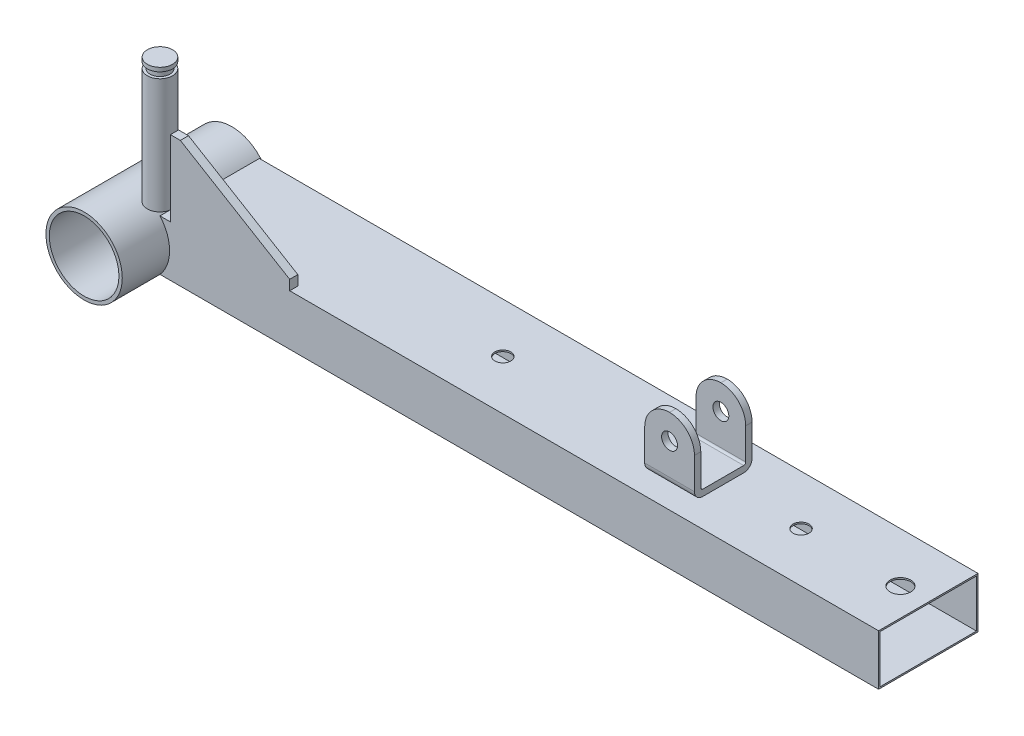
ISO-10303-21;
HEADER;
FILE_DESCRIPTION(('STEP AP214'),'2;1');
FILE_NAME('part.step','',(''),(''),'','','');
FILE_SCHEMA(('AUTOMOTIVE_DESIGN { 1 0 10303 214 1 1 1 1 }'));
ENDSEC;
DATA;
#1=APPLICATION_CONTEXT('core data for automotive mechanical design processes');
#2=APPLICATION_PROTOCOL_DEFINITION('international standard','automotive_design',2000,#1);
#3=PRODUCT_CONTEXT('',#1,'mechanical');
#4=PRODUCT('Part','Part','',(#3));
#5=PRODUCT_RELATED_PRODUCT_CATEGORY('part','',(#4));
#6=PRODUCT_DEFINITION_FORMATION('','',#4);
#7=PRODUCT_DEFINITION_CONTEXT('part definition',#1,'design');
#8=PRODUCT_DEFINITION('design','',#6,#7);
#9=PRODUCT_DEFINITION_SHAPE('','',#8);
#10=(LENGTH_UNIT() NAMED_UNIT(*) SI_UNIT(.MILLI.,.METRE.));
#11=(NAMED_UNIT(*) PLANE_ANGLE_UNIT() SI_UNIT($,.RADIAN.));
#12=(NAMED_UNIT(*) SI_UNIT($,.STERADIAN.) SOLID_ANGLE_UNIT());
#13=UNCERTAINTY_MEASURE_WITH_UNIT(LENGTH_MEASURE(1.E-05),#10,'distance_accuracy_value','');
#14=(GEOMETRIC_REPRESENTATION_CONTEXT(3) GLOBAL_UNCERTAINTY_ASSIGNED_CONTEXT((#13)) GLOBAL_UNIT_ASSIGNED_CONTEXT((#10,
#11,#12)) REPRESENTATION_CONTEXT('',''));
#15=CARTESIAN_POINT('',(0.,0.,0.));
#16=DIRECTION('',(0.,0.,1.));
#17=DIRECTION('',(1.,0.,0.));
#18=AXIS2_PLACEMENT_3D('',#15,#16,#17);
#19=CARTESIAN_POINT('',(13.15,75.7500000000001,49.3));
#20=DIRECTION('',(0.,1.,0.));
#21=DIRECTION('',(0.,0.,0.999999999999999));
#22=AXIS2_PLACEMENT_3D('',#19,#20,#21);
#23=PLANE('',#22);
#24=CARTESIAN_POINT('',(13.15,75.7500000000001,49.3));
#25=DIRECTION('',(0.,1.,0.));
#26=DIRECTION('',(0.,0.,0.999999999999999));
#27=AXIS2_PLACEMENT_3D('',#24,#25,#26);
#28=CIRCLE('',#27,6.35);
#29=CARTESIAN_POINT('',(13.15,75.7500000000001,55.65));
#30=VERTEX_POINT('',#29);
#31=EDGE_CURVE('E286',#30,#30,#28,.T.);
#32=ORIENTED_EDGE('',*,*,#31,.T.);
#33=EDGE_LOOP('',(#32));
#34=FACE_BOUND('',#33,.T.);
#35=CARTESIAN_POINT('',(13.15,75.7500000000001,49.3));
#36=DIRECTION('',(0.,1.,0.));
#37=DIRECTION('',(0.,0.,0.999999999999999));
#38=AXIS2_PLACEMENT_3D('',#35,#36,#37);
#39=CIRCLE('',#38,5.);
#40=CARTESIAN_POINT('',(13.15,75.7500000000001,54.3));
#41=VERTEX_POINT('',#40);
#42=EDGE_CURVE('E277',#41,#41,#39,.T.);
#43=ORIENTED_EDGE('',*,*,#42,.F.);
#44=EDGE_LOOP('',(#43));
#45=FACE_BOUND('',#44,.T.);
#46=ADVANCED_FACE('F29',(#34,#45),#23,.T.);
#47=CARTESIAN_POINT('',(0.,0.,74.2999999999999));
#48=DIRECTION('',(0.,0.,-0.999999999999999));
#49=DIRECTION('',(-1.,0.,0.));
#50=AXIS2_PLACEMENT_3D('',#47,#48,#49);
#51=CYLINDRICAL_SURFACE('',#50,19.2);
#52=CARTESIAN_POINT('',(0.,0.,0.));
#53=DIRECTION('',(0.,0.,0.999999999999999));
#54=DIRECTION('',(1.,0.,0.));
#55=AXIS2_PLACEMENT_3D('',#52,#53,#54);
#56=CIRCLE('',#55,19.2);
#57=CARTESIAN_POINT('',(19.2,0.,0.));
#58=VERTEX_POINT('',#57);
#59=EDGE_CURVE('E436',#58,#58,#56,.T.);
#60=ORIENTED_EDGE('',*,*,#59,.T.);
#61=EDGE_LOOP('',(#60));
#62=FACE_BOUND('',#61,.T.);
#63=CARTESIAN_POINT('',(0.,0.,74.2999999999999));
#64=DIRECTION('',(0.,0.,0.999999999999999));
#65=DIRECTION('',(1.,0.,0.));
#66=AXIS2_PLACEMENT_3D('',#63,#64,#65);
#67=CIRCLE('',#66,19.2);
#68=CARTESIAN_POINT('',(19.2,0.,74.2999999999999));
#69=VERTEX_POINT('',#68);
#70=EDGE_CURVE('E439',#69,#69,#67,.T.);
#71=ORIENTED_EDGE('',*,*,#70,.F.);
#72=EDGE_LOOP('',(#71));
#73=FACE_BOUND('',#72,.T.);
#74=DIRECTION('',(0.,0.,-0.999999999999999));
#75=VECTOR('',#74,1.);
#76=CARTESIAN_POINT('',(14.3553996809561,12.75,74.2999999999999));
#77=LINE('',#76,#75);
#78=CARTESIAN_POINT('',(14.3553996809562,12.75,0.5));
#79=VERTEX_POINT('',#78);
#80=CARTESIAN_POINT('',(14.3553996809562,12.75,50.5));
#81=VERTEX_POINT('',#80);
#82=EDGE_CURVE('E229',#79,#81,#77,.F.);
#83=ORIENTED_EDGE('',*,*,#82,.F.);
#84=CARTESIAN_POINT('',(0.,0.,0.5));
#85=DIRECTION('',(0.,0.,-0.999999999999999));
#86=DIRECTION('',(0.,1.,0.));
#87=AXIS2_PLACEMENT_3D('',#84,#85,#86);
#88=CIRCLE('',#87,19.2);
#89=CARTESIAN_POINT('',(14.3553996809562,-12.75,0.499999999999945));
#90=VERTEX_POINT('',#89);
#91=EDGE_CURVE('E363',#90,#79,#88,.F.);
#92=ORIENTED_EDGE('',*,*,#91,.F.);
#93=DIRECTION('',(0.,0.,-0.999999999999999));
#94=VECTOR('',#93,1.);
#95=CARTESIAN_POINT('',(14.3553996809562,-12.75,74.2999999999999));
#96=LINE('',#95,#94);
#97=CARTESIAN_POINT('',(14.3553996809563,-12.75,50.5));
#98=VERTEX_POINT('',#97);
#99=EDGE_CURVE('E409',#98,#90,#96,.T.);
#100=ORIENTED_EDGE('',*,*,#99,.F.);
#101=CARTESIAN_POINT('',(1.11022302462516E-13,0.,50.5));
#102=DIRECTION('',(0.,0.,0.999999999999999));
#103=DIRECTION('',(1.,0.,0.));
#104=AXIS2_PLACEMENT_3D('',#101,#102,#103);
#105=CIRCLE('',#104,19.2);
#106=EDGE_CURVE('E420',#81,#98,#105,.F.);
#107=ORIENTED_EDGE('',*,*,#106,.F.);
#108=EDGE_LOOP('',(#83,#92,#100,#107));
#109=FACE_BOUND('',#108,.T.);
#110=CARTESIAN_POINT('',(7.31966529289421,17.75,46.7841110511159));
#111=CARTESIAN_POINT('',(7.25426067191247,17.7769583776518,46.9356158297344));
#112=CARTESIAN_POINT('',(7.19462853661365,17.801138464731,47.0901054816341));
#113=CARTESIAN_POINT('',(7.08742070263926,17.8441006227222,47.4039403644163));
#114=CARTESIAN_POINT('',(7.03984486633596,17.8628827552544,47.5632855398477));
#115=CARTESIAN_POINT('',(6.95727368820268,17.8952026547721,47.8856657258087));
#116=CARTESIAN_POINT('',(6.9222740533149,17.9087422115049,48.0486994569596));
#117=CARTESIAN_POINT('',(6.86517591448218,17.9307084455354,48.377342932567));
#118=CARTESIAN_POINT('',(6.84307688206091,17.9391353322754,48.5429525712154));
#119=CARTESIAN_POINT('',(6.81198484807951,17.9509648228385,48.8757192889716));
#120=CARTESIAN_POINT('',(6.80300307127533,17.9543631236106,49.0428775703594));
#121=CARTESIAN_POINT('',(6.79826854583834,17.9561563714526,49.3774074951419));
#122=CARTESIAN_POINT('',(6.80251582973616,17.9545513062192,49.5447791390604));
#123=CARTESIAN_POINT('',(6.82418935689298,17.9463248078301,49.8783846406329));
#124=CARTESIAN_POINT('',(6.84160287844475,17.9397082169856,50.0446194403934));
#125=CARTESIAN_POINT('',(6.88940823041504,17.9214035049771,50.3748635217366));
#126=CARTESIAN_POINT('',(6.91979624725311,17.9097168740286,50.5388734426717));
#127=CARTESIAN_POINT('',(6.99991924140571,17.878571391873,50.8929900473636));
#128=CARTESIAN_POINT('',(7.0521592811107,17.8580891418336,51.0824518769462));
#129=CARTESIAN_POINT('',(7.14317671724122,17.8217866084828,51.3615917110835));
#130=CARTESIAN_POINT('',(7.175610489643,17.8087619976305,51.4537616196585));
#131=CARTESIAN_POINT('',(7.24458535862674,17.7808144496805,51.6362554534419));
#132=CARTESIAN_POINT('',(7.28112634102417,17.7658915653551,51.7265794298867));
#133=CARTESIAN_POINT('',(7.31966529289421,17.75,51.8158889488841));
#134=B_SPLINE_CURVE_WITH_KNOTS('',3,(#110,#111,#112,#113,#114,#115,#116,#117,#118,#119,#120,
#121,#122,#123,#124,#125,#126,#127,#128,#129,#130,#131,#132,#133),.UNSPECIFIED.,.F.,.F.,(4,2,2,
2,2,2,2,2,2,2,2,4),(0.,0.501472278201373,1.00293883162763,1.50423403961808,2.00550871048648,
2.50721208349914,3.00891669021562,3.51013714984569,4.01121038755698,4.60290613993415,
4.89852623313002,5.19413810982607),.UNSPECIFIED.);
#135=CARTESIAN_POINT('',(7.31966529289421,17.75,46.7841110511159));
#136=VERTEX_POINT('',#135);
#137=CARTESIAN_POINT('',(7.31966529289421,17.75,51.8158889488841));
#138=VERTEX_POINT('',#137);
#139=EDGE_CURVE('E11',#136,#138,#134,.T.);
#140=ORIENTED_EDGE('',*,*,#139,.F.);
#141=DIRECTION('',(0.,0.,-0.999999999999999));
#142=VECTOR('',#141,1.);
#143=CARTESIAN_POINT('',(7.3196652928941,17.7499999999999,74.2999999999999));
#144=LINE('',#143,#142);
#145=EDGE_CURVE('E42',#138,#136,#144,.T.);
#146=ORIENTED_EDGE('',*,*,#145,.F.);
#147=EDGE_LOOP('',(#140,#146));
#148=FACE_BOUND('',#147,.T.);
#149=ADVANCED_FACE('F31',(#62,#73,#109,#148),#51,.T.);
#150=CARTESIAN_POINT('',(-19.2010000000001,12.75,0.5));
#151=DIRECTION('',(0.,1.,0.));
#152=DIRECTION('',(0.,0.,0.999999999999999));
#153=AXIS2_PLACEMENT_3D('',#150,#151,#152);
#154=PLANE('',#153);
#155=CARTESIAN_POINT('',(161.8,12.75,25.4999999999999));
#156=DIRECTION('',(0.,1.,0.));
#157=DIRECTION('',(0.,0.,0.999999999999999));
#158=AXIS2_PLACEMENT_3D('',#155,#156,#157);
#159=CIRCLE('',#158,3.99999999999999);
#160=CARTESIAN_POINT('',(161.8,12.75,29.4999999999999));
#161=VERTEX_POINT('',#160);
#162=EDGE_CURVE('E704',#161,#161,#159,.T.);
#163=ORIENTED_EDGE('',*,*,#162,.F.);
#164=EDGE_LOOP('',(#163));
#165=FACE_BOUND('',#164,.T.);
#166=CARTESIAN_POINT('',(361.8,12.75,25.5));
#167=DIRECTION('',(0.,1.,0.));
#168=DIRECTION('',(0.,0.,0.999999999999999));
#169=AXIS2_PLACEMENT_3D('',#166,#167,#168);
#170=CIRCLE('',#169,5.19999999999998);
#171=CARTESIAN_POINT('',(361.8,12.75,30.7));
#172=VERTEX_POINT('',#171);
#173=EDGE_CURVE('E699',#172,#172,#170,.T.);
#174=ORIENTED_EDGE('',*,*,#173,.F.);
#175=EDGE_LOOP('',(#174));
#176=FACE_BOUND('',#175,.T.);
#177=CARTESIAN_POINT('',(311.8,12.75,25.5));
#178=DIRECTION('',(0.,1.,0.));
#179=DIRECTION('',(0.,0.,0.999999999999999));
#180=AXIS2_PLACEMENT_3D('',#177,#178,#179);
#181=CIRCLE('',#180,3.99999999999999);
#182=CARTESIAN_POINT('',(311.8,12.75,29.5));
#183=VERTEX_POINT('',#182);
#184=EDGE_CURVE('E247',#183,#183,#181,.T.);
#185=ORIENTED_EDGE('',*,*,#184,.F.);
#186=EDGE_LOOP('',(#185));
#187=FACE_BOUND('',#186,.T.);
#188=DIRECTION('',(0.,0.,0.999999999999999));
#189=VECTOR('',#188,1.);
#190=CARTESIAN_POINT('',(19.6,12.75,46.4));
#191=LINE('',#190,#189);
#192=CARTESIAN_POINT('',(19.6,12.75,46.4));
#193=VERTEX_POINT('',#192);
#194=CARTESIAN_POINT('',(19.6,12.75,50.5));
#195=VERTEX_POINT('',#194);
#196=EDGE_CURVE('E49',#193,#195,#191,.T.);
#197=ORIENTED_EDGE('',*,*,#196,.F.);
#198=DIRECTION('',(1.,0.,0.));
#199=VECTOR('',#198,1.);
#200=CARTESIAN_POINT('',(19.6,12.75,46.4));
#201=LINE('',#200,#199);
#202=CARTESIAN_POINT('',(79.6,12.75,46.3999999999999));
#203=VERTEX_POINT('',#202);
#204=EDGE_CURVE('E53',#193,#203,#201,.T.);
#205=ORIENTED_EDGE('',*,*,#204,.T.);
#206=DIRECTION('',(0.,0.,0.999999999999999));
#207=VECTOR('',#206,1.);
#208=CARTESIAN_POINT('',(79.6,12.75,46.3999999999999));
#209=LINE('',#208,#207);
#210=CARTESIAN_POINT('',(79.6,12.75,50.4999999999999));
#211=VERTEX_POINT('',#210);
#212=EDGE_CURVE('E231',#203,#211,#209,.T.);
#213=ORIENTED_EDGE('',*,*,#212,.T.);
#214=DIRECTION('',(1.,0.,0.));
#215=VECTOR('',#214,1.);
#216=CARTESIAN_POINT('',(-19.2010000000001,12.75,50.4999999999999));
#217=LINE('',#216,#215);
#218=CARTESIAN_POINT('',(375.8,12.75,50.5));
#219=VERTEX_POINT('',#218);
#220=EDGE_CURVE('E218',#211,#219,#217,.T.);
#221=ORIENTED_EDGE('',*,*,#220,.T.);
#222=DIRECTION('',(0.,0.,0.999999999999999));
#223=VECTOR('',#222,1.);
#224=CARTESIAN_POINT('',(375.8,12.75,0.5));
#225=LINE('',#224,#223);
#226=CARTESIAN_POINT('',(375.8,12.75,0.5));
#227=VERTEX_POINT('',#226);
#228=EDGE_CURVE('E388',#227,#219,#225,.T.);
#229=ORIENTED_EDGE('',*,*,#228,.F.);
#230=DIRECTION('',(1.,0.,0.));
#231=VECTOR('',#230,1.);
#232=CARTESIAN_POINT('',(-19.2010000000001,12.75,0.5));
#233=LINE('',#232,#231);
#234=EDGE_CURVE('E412',#79,#227,#233,.T.);
#235=ORIENTED_EDGE('',*,*,#234,.F.);
#236=ORIENTED_EDGE('',*,*,#82,.T.);
#237=EDGE_CURVE('E228',#81,#195,#217,.T.);
#238=ORIENTED_EDGE('',*,*,#237,.T.);
#239=EDGE_LOOP('',(#197,#205,#213,#221,#229,#235,#236,#238));
#240=FACE_BOUND('',#239,.T.);
#241=DIRECTION('',(1.,0.,0.));
#242=VECTOR('',#241,1.);
#243=CARTESIAN_POINT('',(248.1,12.75,36.2344708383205));
#244=LINE('',#243,#242);
#245=CARTESIAN_POINT('',(248.1,12.75,36.2344708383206));
#246=VERTEX_POINT('',#245);
#247=CARTESIAN_POINT('',(273.1,12.75,36.2344708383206));
#248=VERTEX_POINT('',#247);
#249=EDGE_CURVE('E366',#246,#248,#244,.T.);
#250=ORIENTED_EDGE('',*,*,#249,.F.);
#251=DIRECTION('',(0.,0.,-0.999999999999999));
#252=VECTOR('',#251,1.);
#253=CARTESIAN_POINT('',(248.1,12.75,36.2344708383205));
#254=LINE('',#253,#252);
#255=CARTESIAN_POINT('',(248.1,12.75,15.6344708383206));
#256=VERTEX_POINT('',#255);
#257=EDGE_CURVE('E352',#246,#256,#254,.T.);
#258=ORIENTED_EDGE('',*,*,#257,.T.);
#259=DIRECTION('',(1.,0.,0.));
#260=VECTOR('',#259,1.);
#261=CARTESIAN_POINT('',(248.1,12.75,15.6344708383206));
#262=LINE('',#261,#260);
#263=CARTESIAN_POINT('',(273.1,12.7499999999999,15.6344708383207));
#264=VERTEX_POINT('',#263);
#265=EDGE_CURVE('E364',#256,#264,#262,.T.);
#266=ORIENTED_EDGE('',*,*,#265,.T.);
#267=DIRECTION('',(0.,0.,-0.999999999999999));
#268=VECTOR('',#267,1.);
#269=CARTESIAN_POINT('',(273.1,12.75,36.2344708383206));
#270=LINE('',#269,#268);
#271=EDGE_CURVE('E324',#248,#264,#270,.T.);
#272=ORIENTED_EDGE('',*,*,#271,.F.);
#273=EDGE_LOOP('',(#250,#258,#266,#272));
#274=FACE_BOUND('',#273,.T.);
#275=ADVANCED_FACE('F232',(#165,#176,#187,#240,#274),#154,.T.);
#276=CARTESIAN_POINT('',(0.,0.,74.2999999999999));
#277=DIRECTION('',(0.,0.,0.999999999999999));
#278=DIRECTION('',(1.,0.,0.));
#279=AXIS2_PLACEMENT_3D('',#276,#277,#278);
#280=PLANE('',#279);
#281=ORIENTED_EDGE('',*,*,#70,.T.);
#282=EDGE_LOOP('',(#281));
#283=FACE_BOUND('',#282,.T.);
#284=CARTESIAN_POINT('',(0.,0.,74.2999999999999));
#285=DIRECTION('',(0.,0.,0.999999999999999));
#286=DIRECTION('',(1.,0.,0.));
#287=AXIS2_PLACEMENT_3D('',#284,#285,#286);
#288=CIRCLE('',#287,17.5);
#289=CARTESIAN_POINT('',(-17.5,0.,74.2999999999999));
#290=VERTEX_POINT('',#289);
#291=EDGE_CURVE('E433',#290,#290,#288,.T.);
#292=ORIENTED_EDGE('',*,*,#291,.F.);
#293=EDGE_LOOP('',(#292));
#294=FACE_BOUND('',#293,.T.);
#295=ADVANCED_FACE('F483',(#283,#294),#280,.T.);
#296=CARTESIAN_POINT('',(0.,0.,0.));
#297=DIRECTION('',(0.,0.,0.999999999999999));
#298=DIRECTION('',(1.,0.,0.));
#299=AXIS2_PLACEMENT_3D('',#296,#297,#298);
#300=PLANE('',#299);
#301=ORIENTED_EDGE('',*,*,#59,.F.);
#302=EDGE_LOOP('',(#301));
#303=FACE_BOUND('',#302,.T.);
#304=CARTESIAN_POINT('',(0.,0.,0.));
#305=DIRECTION('',(0.,0.,0.999999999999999));
#306=DIRECTION('',(1.,0.,0.));
#307=AXIS2_PLACEMENT_3D('',#304,#305,#306);
#308=CIRCLE('',#307,17.5);
#309=CARTESIAN_POINT('',(-17.5,0.,0.));
#310=VERTEX_POINT('',#309);
#311=EDGE_CURVE('E417',#310,#310,#308,.T.);
#312=ORIENTED_EDGE('',*,*,#311,.T.);
#313=EDGE_LOOP('',(#312));
#314=FACE_BOUND('',#313,.T.);
#315=ADVANCED_FACE('F549',(#303,#314),#300,.F.);
#316=CARTESIAN_POINT('',(0.,0.,74.2999999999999));
#317=DIRECTION('',(0.,0.,-0.999999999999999));
#318=DIRECTION('',(-1.,0.,0.));
#319=AXIS2_PLACEMENT_3D('',#316,#317,#318);
#320=CYLINDRICAL_SURFACE('',#319,17.5);
#321=CARTESIAN_POINT('',(-17.5,0.,74.2999999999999));
#322=CARTESIAN_POINT('',(-17.5,0.,73.5260416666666));
#323=CARTESIAN_POINT('',(-17.5,0.,72.7520833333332));
#324=CARTESIAN_POINT('',(-17.5,0.,71.2041666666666));
#325=CARTESIAN_POINT('',(-17.5,0.,70.4302083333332));
#326=CARTESIAN_POINT('',(-17.5,0.,68.8822916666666));
#327=CARTESIAN_POINT('',(-17.5,0.,68.1083333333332));
#328=CARTESIAN_POINT('',(-17.5,0.,66.5604166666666));
#329=CARTESIAN_POINT('',(-17.5,0.,65.7864583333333));
#330=CARTESIAN_POINT('',(-17.5,0.,64.2385416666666));
#331=CARTESIAN_POINT('',(-17.5,0.,63.4645833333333));
#332=CARTESIAN_POINT('',(-17.5,0.,61.9166666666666));
#333=CARTESIAN_POINT('',(-17.5,0.,61.1427083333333));
#334=CARTESIAN_POINT('',(-17.5,0.,59.5947916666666));
#335=CARTESIAN_POINT('',(-17.5,0.,58.8208333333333));
#336=CARTESIAN_POINT('',(-17.5,0.,57.2729166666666));
#337=CARTESIAN_POINT('',(-17.5,0.,56.4989583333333));
#338=CARTESIAN_POINT('',(-17.5,0.,54.9510416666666));
#339=CARTESIAN_POINT('',(-17.5,0.,54.1770833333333));
#340=CARTESIAN_POINT('',(-17.5,0.,52.6291666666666));
#341=CARTESIAN_POINT('',(-17.5,0.,51.8552083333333));
#342=CARTESIAN_POINT('',(-17.5,0.,50.3072916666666));
#343=CARTESIAN_POINT('',(-17.5,0.,49.5333333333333));
#344=CARTESIAN_POINT('',(-17.5,0.,47.9854166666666));
#345=CARTESIAN_POINT('',(-17.5,0.,47.2114583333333));
#346=CARTESIAN_POINT('',(-17.5,0.,45.6635416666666));
#347=CARTESIAN_POINT('',(-17.5,0.,44.8895833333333));
#348=CARTESIAN_POINT('',(-17.5,0.,43.3416666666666));
#349=CARTESIAN_POINT('',(-17.5,0.,42.5677083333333));
#350=CARTESIAN_POINT('',(-17.5,0.,41.0197916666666));
#351=CARTESIAN_POINT('',(-17.5,0.,40.2458333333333));
#352=CARTESIAN_POINT('',(-17.5,0.,38.6979166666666));
#353=CARTESIAN_POINT('',(-17.5,0.,37.9239583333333));
#354=CARTESIAN_POINT('',(-17.5,0.,36.3760416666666));
#355=CARTESIAN_POINT('',(-17.5,0.,35.6020833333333));
#356=CARTESIAN_POINT('',(-17.5,0.,34.0541666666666));
#357=CARTESIAN_POINT('',(-17.5,0.,33.2802083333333));
#358=CARTESIAN_POINT('',(-17.5,0.,31.7322916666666));
#359=CARTESIAN_POINT('',(-17.5,0.,30.9583333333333));
#360=CARTESIAN_POINT('',(-17.5,0.,29.4104166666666));
#361=CARTESIAN_POINT('',(-17.5,0.,28.6364583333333));
#362=CARTESIAN_POINT('',(-17.5,0.,27.0885416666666));
#363=CARTESIAN_POINT('',(-17.5,0.,26.3145833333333));
#364=CARTESIAN_POINT('',(-17.5,0.,24.7666666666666));
#365=CARTESIAN_POINT('',(-17.5,0.,23.9927083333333));
#366=CARTESIAN_POINT('',(-17.5,0.,22.4447916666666));
#367=CARTESIAN_POINT('',(-17.5,0.,21.6708333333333));
#368=CARTESIAN_POINT('',(-17.5,0.,20.1229166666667));
#369=CARTESIAN_POINT('',(-17.5,0.,19.3489583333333));
#370=CARTESIAN_POINT('',(-17.5,0.,17.8010416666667));
#371=CARTESIAN_POINT('',(-17.5,0.,17.0270833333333));
#372=CARTESIAN_POINT('',(-17.5,0.,15.4791666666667));
#373=CARTESIAN_POINT('',(-17.5,0.,14.7052083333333));
#374=CARTESIAN_POINT('',(-17.5,0.,13.1572916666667));
#375=CARTESIAN_POINT('',(-17.5,0.,12.3833333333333));
#376=CARTESIAN_POINT('',(-17.5,0.,10.8354166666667));
#377=CARTESIAN_POINT('',(-17.5,0.,10.0614583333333));
#378=CARTESIAN_POINT('',(-17.5,0.,8.51354166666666));
#379=CARTESIAN_POINT('',(-17.5,0.,7.73958333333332));
#380=CARTESIAN_POINT('',(-17.5,0.,6.19166666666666));
#381=CARTESIAN_POINT('',(-17.5,0.,5.41770833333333));
#382=CARTESIAN_POINT('',(-17.5,0.,3.86979166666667));
#383=CARTESIAN_POINT('',(-17.5,0.,3.09583333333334));
#384=CARTESIAN_POINT('',(-17.5,0.,1.54791666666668));
#385=CARTESIAN_POINT('',(-17.5,0.,0.773958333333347));
#386=CARTESIAN_POINT('',(-17.5,0.,0.));
#387=B_SPLINE_CURVE_WITH_KNOTS('',3,(#321,#322,#323,#324,#325,#326,#327,#328,#329,#330,#331,
#332,#333,#334,#335,#336,#337,#338,#339,#340,#341,#342,#343,#344,#345,#346,#347,#348,#349,#350,
#351,#352,#353,#354,#355,#356,#357,#358,#359,#360,#361,#362,#363,#364,#365,#366,#367,#368,#369,
#370,#371,#372,#373,#374,#375,#376,#377,#378,#379,#380,#381,#382,#383,#384,#385,#386),
.UNSPECIFIED.,.F.,.F.,(4,2,2,2,2,2,2,2,2,2,2,2,2,2,2,2,2,2,2,2,2,2,2,2,2,2,2,2,2,2,2,2,4),(0.,
2.32187499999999,4.64374999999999,6.96562499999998,9.28749999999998,11.609375,13.93125,
16.253125,18.575,20.896875,23.21875,25.540625,27.8625,30.1843749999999,32.5062499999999,
34.8281249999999,37.1499999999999,39.4718749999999,41.7937499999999,44.1156249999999,
46.4374999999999,48.7593749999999,51.0812499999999,53.4031249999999,55.7249999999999,
58.0468749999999,60.3687499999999,62.6906249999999,65.0124999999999,67.3343749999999,
69.6562499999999,71.9781249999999,74.2999999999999),.UNSPECIFIED.);
#388=EDGE_CURVE('BSEAM545',#290,#310,#387,.T.);
#389=ORIENTED_EDGE('',*,*,#291,.T.);
#390=ORIENTED_EDGE('',*,*,#311,.F.);
#391=ORIENTED_EDGE('',*,*,#388,.T.);
#392=ORIENTED_EDGE('',*,*,#388,.F.);
#393=EDGE_LOOP('',(#389,#391,#390,#392));
#394=FACE_BOUND('',#393,.T.);
#395=ADVANCED_FACE('F545',(#394),#320,.F.);
#396=CARTESIAN_POINT('',(-19.2010000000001,12.75,0.5));
#397=DIRECTION('',(0.,0.,-0.999999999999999));
#398=DIRECTION('',(0.,1.,0.));
#399=AXIS2_PLACEMENT_3D('',#396,#397,#398);
#400=PLANE('',#399);
#401=DIRECTION('',(1.,0.,0.));
#402=VECTOR('',#401,1.);
#403=CARTESIAN_POINT('',(-19.2010000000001,-12.75,0.5));
#404=LINE('',#403,#402);
#405=CARTESIAN_POINT('',(375.8,-12.75,0.5));
#406=VERTEX_POINT('',#405);
#407=EDGE_CURVE('E411',#90,#406,#404,.T.);
#408=ORIENTED_EDGE('',*,*,#407,.F.);
#409=ORIENTED_EDGE('',*,*,#91,.T.);
#410=ORIENTED_EDGE('',*,*,#234,.T.);
#411=DIRECTION('',(0.,1.,0.));
#412=VECTOR('',#411,1.);
#413=CARTESIAN_POINT('',(375.8,12.75,0.5));
#414=LINE('',#413,#412);
#415=EDGE_CURVE('E390',#406,#227,#414,.T.);
#416=ORIENTED_EDGE('',*,*,#415,.F.);
#417=EDGE_LOOP('',(#408,#409,#410,#416));
#418=FACE_BOUND('',#417,.T.);
#419=ADVANCED_FACE('F541',(#418),#400,.T.);
#420=CARTESIAN_POINT('',(-19.2010000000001,-12.75,0.5));
#421=DIRECTION('',(0.,-1.,0.));
#422=DIRECTION('',(0.,0.,-0.999999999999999));
#423=AXIS2_PLACEMENT_3D('',#420,#421,#422);
#424=PLANE('',#423);
#425=CARTESIAN_POINT('',(161.8,-12.7500000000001,25.5));
#426=DIRECTION('',(0.,-1.,0.));
#427=DIRECTION('',(0.,0.,-0.999999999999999));
#428=AXIS2_PLACEMENT_3D('',#425,#426,#427);
#429=CIRCLE('',#428,5.74999999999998);
#430=CARTESIAN_POINT('',(161.8,-12.7500000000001,19.75));
#431=VERTEX_POINT('',#430);
#432=EDGE_CURVE('E707',#431,#431,#429,.T.);
#433=ORIENTED_EDGE('',*,*,#432,.F.);
#434=EDGE_LOOP('',(#433));
#435=FACE_BOUND('',#434,.T.);
#436=CARTESIAN_POINT('',(311.8,-12.7500000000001,25.5));
#437=DIRECTION('',(0.,-1.,0.));
#438=DIRECTION('',(0.,0.,-0.999999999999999));
#439=AXIS2_PLACEMENT_3D('',#436,#437,#438);
#440=CIRCLE('',#439,5.74999999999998);
#441=CARTESIAN_POINT('',(311.8,-12.7500000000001,19.75));
#442=VERTEX_POINT('',#441);
#443=EDGE_CURVE('E690',#442,#442,#440,.T.);
#444=ORIENTED_EDGE('',*,*,#443,.F.);
#445=EDGE_LOOP('',(#444));
#446=FACE_BOUND('',#445,.T.);
#447=DIRECTION('',(1.,0.,0.));
#448=VECTOR('',#447,1.);
#449=CARTESIAN_POINT('',(-19.201,-12.75,50.5));
#450=LINE('',#449,#448);
#451=CARTESIAN_POINT('',(375.8,-12.75,50.5));
#452=VERTEX_POINT('',#451);
#453=EDGE_CURVE('E414',#98,#452,#450,.T.);
#454=ORIENTED_EDGE('',*,*,#453,.F.);
#455=ORIENTED_EDGE('',*,*,#99,.T.);
#456=ORIENTED_EDGE('',*,*,#407,.T.);
#457=DIRECTION('',(0.,0.,-0.999999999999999));
#458=VECTOR('',#457,1.);
#459=CARTESIAN_POINT('',(375.8,-12.75,0.5));
#460=LINE('',#459,#458);
#461=EDGE_CURVE('E384',#452,#406,#460,.T.);
#462=ORIENTED_EDGE('',*,*,#461,.F.);
#463=EDGE_LOOP('',(#454,#455,#456,#462));
#464=FACE_BOUND('',#463,.T.);
#465=ADVANCED_FACE('F538',(#435,#446,#464),#424,.T.);
#466=CARTESIAN_POINT('',(-19.2010000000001,12.75,50.4999999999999));
#467=DIRECTION('',(0.,0.,0.999999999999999));
#468=DIRECTION('',(1.,0.,0.));
#469=AXIS2_PLACEMENT_3D('',#466,#467,#468);
#470=PLANE('',#469);
#471=ORIENTED_EDGE('',*,*,#237,.F.);
#472=ORIENTED_EDGE('',*,*,#106,.T.);
#473=ORIENTED_EDGE('',*,*,#453,.T.);
#474=DIRECTION('',(0.,-1.,0.));
#475=VECTOR('',#474,1.);
#476=CARTESIAN_POINT('',(375.8,12.75,50.5));
#477=LINE('',#476,#475);
#478=EDGE_CURVE('E225',#219,#452,#477,.T.);
#479=ORIENTED_EDGE('',*,*,#478,.F.);
#480=ORIENTED_EDGE('',*,*,#220,.F.);
#481=DIRECTION('',(0.,1.,0.));
#482=VECTOR('',#481,1.);
#483=CARTESIAN_POINT('',(79.6,12.75,50.4999999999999));
#484=LINE('',#483,#482);
#485=CARTESIAN_POINT('',(79.6000000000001,17.75,50.4999999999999));
#486=VERTEX_POINT('',#485);
#487=EDGE_CURVE('E223',#211,#486,#484,.T.);
#488=ORIENTED_EDGE('',*,*,#487,.T.);
#489=DIRECTION('',(-0.857492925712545,0.514495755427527,0.));
#490=VECTOR('',#489,1.);
#491=CARTESIAN_POINT('',(24.6,50.75,50.4999999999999));
#492=LINE('',#491,#490);
#493=CARTESIAN_POINT('',(24.6,50.75,50.4999999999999));
#494=VERTEX_POINT('',#493);
#495=EDGE_CURVE('E241',#486,#494,#492,.T.);
#496=ORIENTED_EDGE('',*,*,#495,.T.);
#497=DIRECTION('',(-1.,0.,0.));
#498=VECTOR('',#497,1.);
#499=CARTESIAN_POINT('',(19.6,50.75,50.4999999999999));
#500=LINE('',#499,#498);
#501=CARTESIAN_POINT('',(19.6,50.75,50.4999999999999));
#502=VERTEX_POINT('',#501);
#503=EDGE_CURVE('E244',#494,#502,#500,.T.);
#504=ORIENTED_EDGE('',*,*,#503,.T.);
#505=DIRECTION('',(0.,-1.,0.));
#506=VECTOR('',#505,1.);
#507=CARTESIAN_POINT('',(19.6,12.75,50.5));
#508=LINE('',#507,#506);
#509=EDGE_CURVE('E242',#502,#195,#508,.T.);
#510=ORIENTED_EDGE('',*,*,#509,.T.);
#511=EDGE_LOOP('',(#471,#472,#473,#479,#480,#488,#496,#504,#510));
#512=FACE_BOUND('',#511,.T.);
#513=ADVANCED_FACE('F220',(#512),#470,.T.);
#514=CARTESIAN_POINT('',(-19.201,12.,1.25));
#515=DIRECTION('',(0.,0.,-0.999999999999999));
#516=DIRECTION('',(0.,1.,0.));
#517=AXIS2_PLACEMENT_3D('',#514,#515,#516);
#518=PLANE('',#517);
#519=CARTESIAN_POINT('',(0.,0.,1.25));
#520=DIRECTION('',(0.,0.,-0.999999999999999));
#521=DIRECTION('',(0.,1.,0.));
#522=AXIS2_PLACEMENT_3D('',#519,#520,#521);
#523=CIRCLE('',#522,19.2);
#524=CARTESIAN_POINT('',(14.9879951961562,-12.,1.24999999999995));
#525=VERTEX_POINT('',#524);
#526=CARTESIAN_POINT('',(14.9879951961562,12.,1.25));
#527=VERTEX_POINT('',#526);
#528=EDGE_CURVE('E383',#525,#527,#523,.F.);
#529=ORIENTED_EDGE('',*,*,#528,.F.);
#530=DIRECTION('',(1.,0.,0.));
#531=VECTOR('',#530,1.);
#532=CARTESIAN_POINT('',(-19.201,-12.,1.25));
#533=LINE('',#532,#531);
#534=CARTESIAN_POINT('',(375.8,-12.,1.24999999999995));
#535=VERTEX_POINT('',#534);
#536=EDGE_CURVE('E408',#525,#535,#533,.T.);
#537=ORIENTED_EDGE('',*,*,#536,.T.);
#538=DIRECTION('',(0.,1.,0.));
#539=VECTOR('',#538,1.);
#540=CARTESIAN_POINT('',(375.8,12.,1.25));
#541=LINE('',#540,#539);
#542=CARTESIAN_POINT('',(375.8,12.,1.25));
#543=VERTEX_POINT('',#542);
#544=EDGE_CURVE('E405',#535,#543,#541,.T.);
#545=ORIENTED_EDGE('',*,*,#544,.T.);
#546=DIRECTION('',(1.,0.,0.));
#547=VECTOR('',#546,1.);
#548=CARTESIAN_POINT('',(-19.201,12.,1.25));
#549=LINE('',#548,#547);
#550=EDGE_CURVE('E402',#527,#543,#549,.T.);
#551=ORIENTED_EDGE('',*,*,#550,.F.);
#552=EDGE_LOOP('',(#529,#537,#545,#551));
#553=FACE_BOUND('',#552,.T.);
#554=ADVANCED_FACE('F512',(#553),#518,.F.);
#555=CARTESIAN_POINT('',(-19.201,-12.,1.25));
#556=DIRECTION('',(0.,-1.,0.));
#557=DIRECTION('',(0.,0.,-0.999999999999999));
#558=AXIS2_PLACEMENT_3D('',#555,#556,#557);
#559=PLANE('',#558);
#560=CARTESIAN_POINT('',(161.8,-12.0000000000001,25.5));
#561=DIRECTION('',(0.,-1.,0.));
#562=DIRECTION('',(0.,0.,-0.999999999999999));
#563=AXIS2_PLACEMENT_3D('',#560,#561,#562);
#564=CIRCLE('',#563,5.74999999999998);
#565=CARTESIAN_POINT('',(161.8,-12.0000000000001,19.75));
#566=VERTEX_POINT('',#565);
#567=EDGE_CURVE('E710',#566,#566,#564,.F.);
#568=ORIENTED_EDGE('',*,*,#567,.F.);
#569=EDGE_LOOP('',(#568));
#570=FACE_BOUND('',#569,.T.);
#571=CARTESIAN_POINT('',(311.8,-12.0000000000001,25.5));
#572=DIRECTION('',(0.,-1.,0.));
#573=DIRECTION('',(0.,0.,-0.999999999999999));
#574=AXIS2_PLACEMENT_3D('',#571,#572,#573);
#575=CIRCLE('',#574,5.74999999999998);
#576=CARTESIAN_POINT('',(311.8,-12.0000000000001,19.75));
#577=VERTEX_POINT('',#576);
#578=EDGE_CURVE('E694',#577,#577,#575,.F.);
#579=ORIENTED_EDGE('',*,*,#578,.F.);
#580=EDGE_LOOP('',(#579));
#581=FACE_BOUND('',#580,.T.);
#582=DIRECTION('',(0.,0.,-0.999999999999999));
#583=VECTOR('',#582,1.);
#584=CARTESIAN_POINT('',(14.9879951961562,-12.0000000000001,74.2999999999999));
#585=LINE('',#584,#583);
#586=CARTESIAN_POINT('',(14.9879951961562,-12.,49.75));
#587=VERTEX_POINT('',#586);
#588=EDGE_CURVE('E415',#587,#525,#585,.T.);
#589=ORIENTED_EDGE('',*,*,#588,.F.);
#590=DIRECTION('',(1.,0.,0.));
#591=VECTOR('',#590,1.);
#592=CARTESIAN_POINT('',(-19.201,-12.,49.75));
#593=LINE('',#592,#591);
#594=CARTESIAN_POINT('',(375.8,-12.,49.75));
#595=VERTEX_POINT('',#594);
#596=EDGE_CURVE('E398',#587,#595,#593,.T.);
#597=ORIENTED_EDGE('',*,*,#596,.T.);
#598=DIRECTION('',(0.,0.,-0.999999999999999));
#599=VECTOR('',#598,1.);
#600=CARTESIAN_POINT('',(375.8,-12.,1.24999999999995));
#601=LINE('',#600,#599);
#602=EDGE_CURVE('E394',#595,#535,#601,.T.);
#603=ORIENTED_EDGE('',*,*,#602,.T.);
#604=ORIENTED_EDGE('',*,*,#536,.F.);
#605=EDGE_LOOP('',(#589,#597,#603,#604));
#606=FACE_BOUND('',#605,.T.);
#607=ADVANCED_FACE('F522',(#570,#581,#606),#559,.F.);
#608=CARTESIAN_POINT('',(-19.201,12.,49.7499999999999));
#609=DIRECTION('',(0.,0.,0.999999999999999));
#610=DIRECTION('',(1.,0.,0.));
#611=AXIS2_PLACEMENT_3D('',#608,#609,#610);
#612=PLANE('',#611);
#613=CARTESIAN_POINT('',(1.11022302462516E-13,0.,49.75));
#614=DIRECTION('',(0.,0.,0.999999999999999));
#615=DIRECTION('',(1.,0.,0.));
#616=AXIS2_PLACEMENT_3D('',#613,#614,#615);
#617=CIRCLE('',#616,19.2);
#618=CARTESIAN_POINT('',(14.9879951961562,12.,49.75));
#619=VERTEX_POINT('',#618);
#620=EDGE_CURVE('E382',#619,#587,#617,.F.);
#621=ORIENTED_EDGE('',*,*,#620,.F.);
#622=DIRECTION('',(1.,0.,0.));
#623=VECTOR('',#622,1.);
#624=CARTESIAN_POINT('',(-19.201,12.,49.7499999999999));
#625=LINE('',#624,#623);
#626=CARTESIAN_POINT('',(375.8,12.,49.75));
#627=VERTEX_POINT('',#626);
#628=EDGE_CURVE('E397',#619,#627,#625,.T.);
#629=ORIENTED_EDGE('',*,*,#628,.T.);
#630=DIRECTION('',(0.,-1.,0.));
#631=VECTOR('',#630,1.);
#632=CARTESIAN_POINT('',(375.8,12.,49.75));
#633=LINE('',#632,#631);
#634=EDGE_CURVE('E399',#627,#595,#633,.T.);
#635=ORIENTED_EDGE('',*,*,#634,.T.);
#636=ORIENTED_EDGE('',*,*,#596,.F.);
#637=EDGE_LOOP('',(#621,#629,#635,#636));
#638=FACE_BOUND('',#637,.T.);
#639=ADVANCED_FACE('F520',(#638),#612,.F.);
#640=CARTESIAN_POINT('',(-19.201,12.,1.25));
#641=DIRECTION('',(0.,1.,0.));
#642=DIRECTION('',(0.,0.,0.999999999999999));
#643=AXIS2_PLACEMENT_3D('',#640,#641,#642);
#644=PLANE('',#643);
#645=CARTESIAN_POINT('',(161.8,12.,25.4999999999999));
#646=DIRECTION('',(0.,1.,0.));
#647=DIRECTION('',(0.,0.,0.999999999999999));
#648=AXIS2_PLACEMENT_3D('',#645,#646,#647);
#649=CIRCLE('',#648,3.99999999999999);
#650=CARTESIAN_POINT('',(161.8,12.,29.4999999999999));
#651=VERTEX_POINT('',#650);
#652=EDGE_CURVE('E681',#651,#651,#649,.F.);
#653=ORIENTED_EDGE('',*,*,#652,.F.);
#654=EDGE_LOOP('',(#653));
#655=FACE_BOUND('',#654,.T.);
#656=CARTESIAN_POINT('',(361.8,12.,25.5));
#657=DIRECTION('',(0.,1.,0.));
#658=DIRECTION('',(0.,0.,0.999999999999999));
#659=AXIS2_PLACEMENT_3D('',#656,#657,#658);
#660=CIRCLE('',#659,5.19999999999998);
#661=CARTESIAN_POINT('',(361.8,12.,30.7));
#662=VERTEX_POINT('',#661);
#663=EDGE_CURVE('E685',#662,#662,#660,.F.);
#664=ORIENTED_EDGE('',*,*,#663,.F.);
#665=EDGE_LOOP('',(#664));
#666=FACE_BOUND('',#665,.T.);
#667=CARTESIAN_POINT('',(311.8,12.,25.5));
#668=DIRECTION('',(0.,1.,0.));
#669=DIRECTION('',(0.,0.,0.999999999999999));
#670=AXIS2_PLACEMENT_3D('',#667,#668,#669);
#671=CIRCLE('',#670,3.99999999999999);
#672=CARTESIAN_POINT('',(311.8,12.,29.5));
#673=VERTEX_POINT('',#672);
#674=EDGE_CURVE('E688',#673,#673,#671,.F.);
#675=ORIENTED_EDGE('',*,*,#674,.F.);
#676=EDGE_LOOP('',(#675));
#677=FACE_BOUND('',#676,.T.);
#678=DIRECTION('',(0.,0.,-0.999999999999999));
#679=VECTOR('',#678,1.);
#680=CARTESIAN_POINT('',(14.9879951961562,12.,74.2999999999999));
#681=LINE('',#680,#679);
#682=EDGE_CURVE('E380',#527,#619,#681,.F.);
#683=ORIENTED_EDGE('',*,*,#682,.F.);
#684=ORIENTED_EDGE('',*,*,#550,.T.);
#685=DIRECTION('',(0.,0.,0.999999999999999));
#686=VECTOR('',#685,1.);
#687=CARTESIAN_POINT('',(375.8,12.,1.25));
#688=LINE('',#687,#686);
#689=EDGE_CURVE('E393',#543,#627,#688,.T.);
#690=ORIENTED_EDGE('',*,*,#689,.T.);
#691=ORIENTED_EDGE('',*,*,#628,.F.);
#692=EDGE_LOOP('',(#683,#684,#690,#691));
#693=FACE_BOUND('',#692,.T.);
#694=ADVANCED_FACE('F500',(#655,#666,#677,#693),#644,.F.);
#695=CARTESIAN_POINT('',(375.8,-12.75,0.5));
#696=DIRECTION('',(-1.,0.,0.));
#697=DIRECTION('',(0.,0.,0.999999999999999));
#698=AXIS2_PLACEMENT_3D('',#695,#696,#697);
#699=PLANE('',#698);
#700=ORIENTED_EDGE('',*,*,#689,.F.);
#701=ORIENTED_EDGE('',*,*,#544,.F.);
#702=ORIENTED_EDGE('',*,*,#602,.F.);
#703=ORIENTED_EDGE('',*,*,#634,.F.);
#704=EDGE_LOOP('',(#700,#701,#702,#703));
#705=FACE_BOUND('',#704,.T.);
#706=ORIENTED_EDGE('',*,*,#415,.T.);
#707=ORIENTED_EDGE('',*,*,#228,.T.);
#708=ORIENTED_EDGE('',*,*,#478,.T.);
#709=ORIENTED_EDGE('',*,*,#461,.T.);
#710=EDGE_LOOP('',(#706,#707,#708,#709));
#711=FACE_BOUND('',#710,.T.);
#712=ADVANCED_FACE('F491',(#705,#711),#699,.F.);
#713=ORIENTED_EDGE('',*,*,#528,.T.);
#714=ORIENTED_EDGE('',*,*,#682,.T.);
#715=ORIENTED_EDGE('',*,*,#620,.T.);
#716=ORIENTED_EDGE('',*,*,#588,.T.);
#717=EDGE_LOOP('',(#713,#714,#715,#716));
#718=FACE_BOUND('',#717,.T.);
#719=ADVANCED_FACE('F478',(#718),#51,.T.);
#720=CARTESIAN_POINT('',(248.1,16.95,11.4344708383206));
#721=DIRECTION('',(0.,0.,-0.999999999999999));
#722=DIRECTION('',(-1.,0.,0.));
#723=AXIS2_PLACEMENT_3D('',#720,#721,#722);
#724=PLANE('',#723);
#725=CARTESIAN_POINT('',(260.6,32.75,11.4344708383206));
#726=DIRECTION('',(0.,0.,-0.999999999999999));
#727=DIRECTION('',(-1.,0.,0.));
#728=AXIS2_PLACEMENT_3D('',#725,#726,#727);
#729=CIRCLE('',#728,3.99999999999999);
#730=CARTESIAN_POINT('',(264.6,32.75,11.4344708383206));
#731=VERTEX_POINT('',#730);
#732=EDGE_CURVE('E296',#731,#731,#729,.T.);
#733=ORIENTED_EDGE('',*,*,#732,.F.);
#734=EDGE_LOOP('',(#733));
#735=FACE_BOUND('',#734,.T.);
#736=CARTESIAN_POINT('',(260.6,32.75,11.4344708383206));
#737=DIRECTION('',(0.,0.,-0.999999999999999));
#738=DIRECTION('',(-1.,0.,0.));
#739=AXIS2_PLACEMENT_3D('',#736,#737,#738);
#740=CIRCLE('',#739,12.5);
#741=CARTESIAN_POINT('',(248.1,32.75,11.4344708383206));
#742=VERTEX_POINT('',#741);
#743=CARTESIAN_POINT('',(260.6,45.25,11.4344708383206));
#744=VERTEX_POINT('',#743);
#745=EDGE_CURVE('E460',#742,#744,#740,.T.);
#746=ORIENTED_EDGE('',*,*,#745,.T.);
#747=CARTESIAN_POINT('',(260.6,32.75,11.4344708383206));
#748=DIRECTION('',(0.,0.,-0.999999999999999));
#749=DIRECTION('',(-1.,0.,0.));
#750=AXIS2_PLACEMENT_3D('',#747,#748,#749);
#751=CIRCLE('',#750,12.5);
#752=CARTESIAN_POINT('',(273.1,32.75,11.4344708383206));
#753=VERTEX_POINT('',#752);
#754=EDGE_CURVE('E462',#744,#753,#751,.T.);
#755=ORIENTED_EDGE('',*,*,#754,.T.);
#756=DIRECTION('',(0.,1.,0.));
#757=VECTOR('',#756,1.);
#758=CARTESIAN_POINT('',(273.1,16.95,11.4344708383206));
#759=LINE('',#758,#757);
#760=CARTESIAN_POINT('',(273.1,16.95,11.4344708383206));
#761=VERTEX_POINT('',#760);
#762=EDGE_CURVE('E330',#761,#753,#759,.T.);
#763=ORIENTED_EDGE('',*,*,#762,.F.);
#764=DIRECTION('',(1.,0.,0.));
#765=VECTOR('',#764,1.);
#766=CARTESIAN_POINT('',(248.1,16.95,11.4344708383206));
#767=LINE('',#766,#765);
#768=CARTESIAN_POINT('',(248.1,16.95,11.4344708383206));
#769=VERTEX_POINT('',#768);
#770=EDGE_CURVE('E361',#769,#761,#767,.T.);
#771=ORIENTED_EDGE('',*,*,#770,.F.);
#772=DIRECTION('',(0.,1.,0.));
#773=VECTOR('',#772,1.);
#774=CARTESIAN_POINT('',(248.1,16.95,11.4344708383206));
#775=LINE('',#774,#773);
#776=EDGE_CURVE('E357',#769,#742,#775,.T.);
#777=ORIENTED_EDGE('',*,*,#776,.T.);
#778=EDGE_LOOP('',(#746,#755,#763,#771,#777));
#779=FACE_BOUND('',#778,.T.);
#780=ADVANCED_FACE('F490',(#735,#779),#724,.T.);
#781=CARTESIAN_POINT('',(248.1,16.95,15.6344708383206));
#782=DIRECTION('',(1.,0.,0.));
#783=DIRECTION('',(0.,0.,-0.999999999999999));
#784=AXIS2_PLACEMENT_3D('',#781,#782,#783);
#785=CYLINDRICAL_SURFACE('',#784,4.2);
#786=CARTESIAN_POINT('',(273.1,16.95,15.6344708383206));
#787=DIRECTION('',(1.,0.,0.));
#788=DIRECTION('',(0.,0.,-0.999999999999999));
#789=AXIS2_PLACEMENT_3D('',#786,#787,#788);
#790=CIRCLE('',#789,4.2);
#791=EDGE_CURVE('E327',#264,#761,#790,.T.);
#792=ORIENTED_EDGE('',*,*,#791,.F.);
#793=ORIENTED_EDGE('',*,*,#265,.F.);
#794=CARTESIAN_POINT('',(248.1,16.95,15.6344708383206));
#795=DIRECTION('',(1.,0.,0.));
#796=DIRECTION('',(0.,0.,-0.999999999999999));
#797=AXIS2_PLACEMENT_3D('',#794,#795,#796);
#798=CIRCLE('',#797,4.2);
#799=EDGE_CURVE('E354',#256,#769,#798,.T.);
#800=ORIENTED_EDGE('',*,*,#799,.T.);
#801=ORIENTED_EDGE('',*,*,#770,.T.);
#802=EDGE_LOOP('',(#792,#793,#800,#801));
#803=FACE_BOUND('',#802,.T.);
#804=ADVANCED_FACE('F497',(#803),#785,.T.);
#805=CARTESIAN_POINT('',(248.1,16.95,36.2344708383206));
#806=DIRECTION('',(1.,0.,0.));
#807=DIRECTION('',(0.,0.,-0.999999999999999));
#808=AXIS2_PLACEMENT_3D('',#805,#806,#807);
#809=CYLINDRICAL_SURFACE('',#808,4.2);
#810=CARTESIAN_POINT('',(273.1,16.95,36.2344708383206));
#811=DIRECTION('',(1.,0.,0.));
#812=DIRECTION('',(0.,0.,0.999999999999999));
#813=AXIS2_PLACEMENT_3D('',#810,#811,#812);
#814=CIRCLE('',#813,4.2);
#815=CARTESIAN_POINT('',(273.1,16.95,40.4344708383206));
#816=VERTEX_POINT('',#815);
#817=EDGE_CURVE('E321',#816,#248,#814,.T.);
#818=ORIENTED_EDGE('',*,*,#817,.F.);
#819=DIRECTION('',(1.,0.,0.));
#820=VECTOR('',#819,1.);
#821=CARTESIAN_POINT('',(248.1,16.95,40.4344708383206));
#822=LINE('',#821,#820);
#823=CARTESIAN_POINT('',(248.1,16.95,40.4344708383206));
#824=VERTEX_POINT('',#823);
#825=EDGE_CURVE('E369',#824,#816,#822,.T.);
#826=ORIENTED_EDGE('',*,*,#825,.F.);
#827=CARTESIAN_POINT('',(248.1,16.95,36.2344708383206));
#828=DIRECTION('',(1.,0.,0.));
#829=DIRECTION('',(0.,0.,0.999999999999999));
#830=AXIS2_PLACEMENT_3D('',#827,#828,#829);
#831=CIRCLE('',#830,4.2);
#832=EDGE_CURVE('E349',#824,#246,#831,.T.);
#833=ORIENTED_EDGE('',*,*,#832,.T.);
#834=ORIENTED_EDGE('',*,*,#249,.T.);
#835=EDGE_LOOP('',(#818,#826,#833,#834));
#836=FACE_BOUND('',#835,.T.);
#837=ADVANCED_FACE('F647',(#836),#809,.T.);
#838=CARTESIAN_POINT('',(248.1,16.95,40.4344708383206));
#839=DIRECTION('',(0.,0.,0.999999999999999));
#840=DIRECTION('',(1.,0.,0.));
#841=AXIS2_PLACEMENT_3D('',#838,#839,#840);
#842=PLANE('',#841);
#843=CARTESIAN_POINT('',(260.6,32.75,40.4344708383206));
#844=DIRECTION('',(0.,0.,0.999999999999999));
#845=DIRECTION('',(1.,0.,0.));
#846=AXIS2_PLACEMENT_3D('',#843,#844,#845);
#847=CIRCLE('',#846,3.99999999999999);
#848=CARTESIAN_POINT('',(264.6,32.75,40.4344708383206));
#849=VERTEX_POINT('',#848);
#850=EDGE_CURVE('E289',#849,#849,#847,.T.);
#851=ORIENTED_EDGE('',*,*,#850,.F.);
#852=EDGE_LOOP('',(#851));
#853=FACE_BOUND('',#852,.T.);
#854=DIRECTION('',(0.,-1.,0.));
#855=VECTOR('',#854,1.);
#856=CARTESIAN_POINT('',(273.1,16.95,40.4344708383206));
#857=LINE('',#856,#855);
#858=CARTESIAN_POINT('',(273.1,32.75,40.4344708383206));
#859=VERTEX_POINT('',#858);
#860=EDGE_CURVE('E319',#859,#816,#857,.T.);
#861=ORIENTED_EDGE('',*,*,#860,.F.);
#862=CARTESIAN_POINT('',(260.6,32.75,40.4344708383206));
#863=DIRECTION('',(0.,0.,0.999999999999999));
#864=DIRECTION('',(1.,0.,0.));
#865=AXIS2_PLACEMENT_3D('',#862,#863,#864);
#866=CIRCLE('',#865,12.5);
#867=CARTESIAN_POINT('',(260.6,45.25,40.4344708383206));
#868=VERTEX_POINT('',#867);
#869=EDGE_CURVE('E450',#859,#868,#866,.T.);
#870=ORIENTED_EDGE('',*,*,#869,.T.);
#871=CARTESIAN_POINT('',(260.6,32.75,40.4344708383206));
#872=DIRECTION('',(0.,0.,0.999999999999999));
#873=DIRECTION('',(1.,0.,0.));
#874=AXIS2_PLACEMENT_3D('',#871,#872,#873);
#875=CIRCLE('',#874,12.5);
#876=CARTESIAN_POINT('',(248.1,32.75,40.4344708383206));
#877=VERTEX_POINT('',#876);
#878=EDGE_CURVE('E448',#868,#877,#875,.T.);
#879=ORIENTED_EDGE('',*,*,#878,.T.);
#880=DIRECTION('',(0.,-1.,0.));
#881=VECTOR('',#880,1.);
#882=CARTESIAN_POINT('',(248.1,16.95,40.4344708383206));
#883=LINE('',#882,#881);
#884=EDGE_CURVE('E347',#877,#824,#883,.T.);
#885=ORIENTED_EDGE('',*,*,#884,.T.);
#886=ORIENTED_EDGE('',*,*,#825,.T.);
#887=EDGE_LOOP('',(#861,#870,#879,#885,#886));
#888=FACE_BOUND('',#887,.T.);
#889=ADVANCED_FACE('F651',(#853,#888),#842,.T.);
#890=CARTESIAN_POINT('',(248.1,16.95,37.2344708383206));
#891=DIRECTION('',(0.,0.,-0.999999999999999));
#892=DIRECTION('',(-1.,0.,0.));
#893=AXIS2_PLACEMENT_3D('',#890,#891,#892);
#894=PLANE('',#893);
#895=CARTESIAN_POINT('',(260.6,32.75,37.2344708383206));
#896=DIRECTION('',(0.,0.,-0.999999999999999));
#897=DIRECTION('',(-1.,0.,0.));
#898=AXIS2_PLACEMENT_3D('',#895,#896,#897);
#899=CIRCLE('',#898,3.99999999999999);
#900=CARTESIAN_POINT('',(264.6,32.75,37.2344708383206));
#901=VERTEX_POINT('',#900);
#902=EDGE_CURVE('E293',#901,#901,#899,.T.);
#903=ORIENTED_EDGE('',*,*,#902,.F.);
#904=EDGE_LOOP('',(#903));
#905=FACE_BOUND('',#904,.T.);
#906=CARTESIAN_POINT('',(260.6,32.75,37.2344708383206));
#907=DIRECTION('',(0.,0.,-0.999999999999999));
#908=DIRECTION('',(-1.,0.,0.));
#909=AXIS2_PLACEMENT_3D('',#906,#907,#908);
#910=CIRCLE('',#909,12.5);
#911=CARTESIAN_POINT('',(248.1,32.75,37.2344708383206));
#912=VERTEX_POINT('',#911);
#913=CARTESIAN_POINT('',(260.6,45.25,37.2344708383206));
#914=VERTEX_POINT('',#913);
#915=EDGE_CURVE('E452',#912,#914,#910,.T.);
#916=ORIENTED_EDGE('',*,*,#915,.T.);
#917=CARTESIAN_POINT('',(260.6,32.75,37.2344708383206));
#918=DIRECTION('',(0.,0.,-0.999999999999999));
#919=DIRECTION('',(-1.,0.,0.));
#920=AXIS2_PLACEMENT_3D('',#917,#918,#919);
#921=CIRCLE('',#920,12.5);
#922=CARTESIAN_POINT('',(273.1,32.75,37.2344708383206));
#923=VERTEX_POINT('',#922);
#924=EDGE_CURVE('E454',#914,#923,#921,.T.);
#925=ORIENTED_EDGE('',*,*,#924,.T.);
#926=DIRECTION('',(0.,1.,0.));
#927=VECTOR('',#926,1.);
#928=CARTESIAN_POINT('',(273.1,16.95,37.2344708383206));
#929=LINE('',#928,#927);
#930=CARTESIAN_POINT('',(273.1,16.95,37.2344708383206));
#931=VERTEX_POINT('',#930);
#932=EDGE_CURVE('E316',#931,#923,#929,.T.);
#933=ORIENTED_EDGE('',*,*,#932,.F.);
#934=DIRECTION('',(1.,0.,0.));
#935=VECTOR('',#934,1.);
#936=CARTESIAN_POINT('',(248.1,16.95,37.2344708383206));
#937=LINE('',#936,#935);
#938=CARTESIAN_POINT('',(248.1,16.95,37.2344708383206));
#939=VERTEX_POINT('',#938);
#940=EDGE_CURVE('E372',#939,#931,#937,.T.);
#941=ORIENTED_EDGE('',*,*,#940,.F.);
#942=DIRECTION('',(0.,1.,0.));
#943=VECTOR('',#942,1.);
#944=CARTESIAN_POINT('',(248.1,16.95,37.2344708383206));
#945=LINE('',#944,#943);
#946=EDGE_CURVE('E344',#939,#912,#945,.T.);
#947=ORIENTED_EDGE('',*,*,#946,.T.);
#948=EDGE_LOOP('',(#916,#925,#933,#941,#947));
#949=FACE_BOUND('',#948,.T.);
#950=ADVANCED_FACE('F655',(#905,#949),#894,.T.);
#951=CARTESIAN_POINT('',(248.1,16.95,36.2344708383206));
#952=DIRECTION('',(1.,0.,0.));
#953=DIRECTION('',(0.,0.,-0.999999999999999));
#954=AXIS2_PLACEMENT_3D('',#951,#952,#953);
#955=CYLINDRICAL_SURFACE('',#954,1.);
#956=CARTESIAN_POINT('',(273.1,16.95,36.2344708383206));
#957=DIRECTION('',(-1.,0.,0.));
#958=DIRECTION('',(0.,0.,-0.999999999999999));
#959=AXIS2_PLACEMENT_3D('',#956,#957,#958);
#960=CIRCLE('',#959,1.);
#961=CARTESIAN_POINT('',(273.1,15.95,36.2344708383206));
#962=VERTEX_POINT('',#961);
#963=EDGE_CURVE('E313',#962,#931,#960,.T.);
#964=ORIENTED_EDGE('',*,*,#963,.F.);
#965=DIRECTION('',(1.,0.,0.));
#966=VECTOR('',#965,1.);
#967=CARTESIAN_POINT('',(248.1,15.95,36.2344708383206));
#968=LINE('',#967,#966);
#969=CARTESIAN_POINT('',(248.1,15.95,36.2344708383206));
#970=VERTEX_POINT('',#969);
#971=EDGE_CURVE('E374',#970,#962,#968,.T.);
#972=ORIENTED_EDGE('',*,*,#971,.F.);
#973=CARTESIAN_POINT('',(248.1,16.95,36.2344708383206));
#974=DIRECTION('',(-1.,0.,0.));
#975=DIRECTION('',(0.,0.,-0.999999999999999));
#976=AXIS2_PLACEMENT_3D('',#973,#974,#975);
#977=CIRCLE('',#976,1.);
#978=EDGE_CURVE('E341',#970,#939,#977,.T.);
#979=ORIENTED_EDGE('',*,*,#978,.T.);
#980=ORIENTED_EDGE('',*,*,#940,.T.);
#981=EDGE_LOOP('',(#964,#972,#979,#980));
#982=FACE_BOUND('',#981,.T.);
#983=ADVANCED_FACE('F659',(#982),#955,.F.);
#984=CARTESIAN_POINT('',(248.1,15.95,36.2344708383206));
#985=DIRECTION('',(0.,1.,0.));
#986=DIRECTION('',(0.,0.,0.999999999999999));
#987=AXIS2_PLACEMENT_3D('',#984,#985,#986);
#988=PLANE('',#987);
#989=DIRECTION('',(0.,0.,0.999999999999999));
#990=VECTOR('',#989,1.);
#991=CARTESIAN_POINT('',(273.1,15.95,36.2344708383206));
#992=LINE('',#991,#990);
#993=CARTESIAN_POINT('',(273.1,15.95,15.6344708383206));
#994=VERTEX_POINT('',#993);
#995=EDGE_CURVE('E310',#994,#962,#992,.T.);
#996=ORIENTED_EDGE('',*,*,#995,.F.);
#997=DIRECTION('',(1.,0.,0.));
#998=VECTOR('',#997,1.);
#999=CARTESIAN_POINT('',(248.1,15.95,15.6344708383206));
#1000=LINE('',#999,#998);
#1001=CARTESIAN_POINT('',(248.1,15.95,15.6344708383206));
#1002=VERTEX_POINT('',#1001);
#1003=EDGE_CURVE('E376',#1002,#994,#1000,.T.);
#1004=ORIENTED_EDGE('',*,*,#1003,.F.);
#1005=DIRECTION('',(0.,0.,0.999999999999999));
#1006=VECTOR('',#1005,1.);
#1007=CARTESIAN_POINT('',(248.1,15.95,36.2344708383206));
#1008=LINE('',#1007,#1006);
#1009=EDGE_CURVE('E338',#1002,#970,#1008,.T.);
#1010=ORIENTED_EDGE('',*,*,#1009,.T.);
#1011=ORIENTED_EDGE('',*,*,#971,.T.);
#1012=EDGE_LOOP('',(#996,#1004,#1010,#1011));
#1013=FACE_BOUND('',#1012,.T.);
#1014=ADVANCED_FACE('F663',(#1013),#988,.T.);
#1015=CARTESIAN_POINT('',(248.1,16.95,15.6344708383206));
#1016=DIRECTION('',(1.,0.,0.));
#1017=DIRECTION('',(0.,0.,-0.999999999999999));
#1018=AXIS2_PLACEMENT_3D('',#1015,#1016,#1017);
#1019=CYLINDRICAL_SURFACE('',#1018,1.);
#1020=CARTESIAN_POINT('',(273.1,16.95,15.6344708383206));
#1021=DIRECTION('',(-1.,0.,0.));
#1022=DIRECTION('',(0.,0.,-0.999999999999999));
#1023=AXIS2_PLACEMENT_3D('',#1020,#1021,#1022);
#1024=CIRCLE('',#1023,1.);
#1025=CARTESIAN_POINT('',(273.1,16.95,14.6344708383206));
#1026=VERTEX_POINT('',#1025);
#1027=EDGE_CURVE('E307',#1026,#994,#1024,.T.);
#1028=ORIENTED_EDGE('',*,*,#1027,.F.);
#1029=DIRECTION('',(1.,0.,0.));
#1030=VECTOR('',#1029,1.);
#1031=CARTESIAN_POINT('',(248.1,16.95,14.6344708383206));
#1032=LINE('',#1031,#1030);
#1033=CARTESIAN_POINT('',(248.1,16.95,14.6344708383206));
#1034=VERTEX_POINT('',#1033);
#1035=EDGE_CURVE('E360',#1034,#1026,#1032,.T.);
#1036=ORIENTED_EDGE('',*,*,#1035,.F.);
#1037=CARTESIAN_POINT('',(248.1,16.95,15.6344708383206));
#1038=DIRECTION('',(-1.,0.,0.));
#1039=DIRECTION('',(0.,0.,-0.999999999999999));
#1040=AXIS2_PLACEMENT_3D('',#1037,#1038,#1039);
#1041=CIRCLE('',#1040,1.);
#1042=EDGE_CURVE('E335',#1034,#1002,#1041,.T.);
#1043=ORIENTED_EDGE('',*,*,#1042,.T.);
#1044=ORIENTED_EDGE('',*,*,#1003,.T.);
#1045=EDGE_LOOP('',(#1028,#1036,#1043,#1044));
#1046=FACE_BOUND('',#1045,.T.);
#1047=ADVANCED_FACE('F667',(#1046),#1019,.F.);
#1048=CARTESIAN_POINT('',(248.1,16.95,14.6344708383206));
#1049=DIRECTION('',(0.,0.,0.999999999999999));
#1050=DIRECTION('',(1.,0.,0.));
#1051=AXIS2_PLACEMENT_3D('',#1048,#1049,#1050);
#1052=PLANE('',#1051);
#1053=CARTESIAN_POINT('',(260.6,32.75,14.6344708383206));
#1054=DIRECTION('',(0.,0.,0.999999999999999));
#1055=DIRECTION('',(1.,0.,0.));
#1056=AXIS2_PLACEMENT_3D('',#1053,#1054,#1055);
#1057=CIRCLE('',#1056,3.99999999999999);
#1058=CARTESIAN_POINT('',(264.6,32.75,14.6344708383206));
#1059=VERTEX_POINT('',#1058);
#1060=EDGE_CURVE('E292',#1059,#1059,#1057,.T.);
#1061=ORIENTED_EDGE('',*,*,#1060,.F.);
#1062=EDGE_LOOP('',(#1061));
#1063=FACE_BOUND('',#1062,.T.);
#1064=DIRECTION('',(0.,-1.,0.));
#1065=VECTOR('',#1064,1.);
#1066=CARTESIAN_POINT('',(273.1,16.95,14.6344708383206));
#1067=LINE('',#1066,#1065);
#1068=CARTESIAN_POINT('',(273.1,32.75,14.6344708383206));
#1069=VERTEX_POINT('',#1068);
#1070=EDGE_CURVE('E305',#1069,#1026,#1067,.T.);
#1071=ORIENTED_EDGE('',*,*,#1070,.F.);
#1072=CARTESIAN_POINT('',(260.6,32.75,14.6344708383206));
#1073=DIRECTION('',(0.,0.,0.999999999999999));
#1074=DIRECTION('',(1.,0.,0.));
#1075=AXIS2_PLACEMENT_3D('',#1072,#1073,#1074);
#1076=CIRCLE('',#1075,12.5);
#1077=CARTESIAN_POINT('',(260.6,45.25,14.6344708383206));
#1078=VERTEX_POINT('',#1077);
#1079=EDGE_CURVE('E458',#1069,#1078,#1076,.T.);
#1080=ORIENTED_EDGE('',*,*,#1079,.T.);
#1081=CARTESIAN_POINT('',(260.6,32.75,14.6344708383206));
#1082=DIRECTION('',(0.,0.,0.999999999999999));
#1083=DIRECTION('',(1.,0.,0.));
#1084=AXIS2_PLACEMENT_3D('',#1081,#1082,#1083);
#1085=CIRCLE('',#1084,12.5);
#1086=CARTESIAN_POINT('',(248.1,32.75,14.6344708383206));
#1087=VERTEX_POINT('',#1086);
#1088=EDGE_CURVE('E456',#1078,#1087,#1085,.T.);
#1089=ORIENTED_EDGE('',*,*,#1088,.T.);
#1090=DIRECTION('',(0.,-1.,0.));
#1091=VECTOR('',#1090,1.);
#1092=CARTESIAN_POINT('',(248.1,16.95,14.6344708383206));
#1093=LINE('',#1092,#1091);
#1094=EDGE_CURVE('E333',#1087,#1034,#1093,.T.);
#1095=ORIENTED_EDGE('',*,*,#1094,.T.);
#1096=ORIENTED_EDGE('',*,*,#1035,.T.);
#1097=EDGE_LOOP('',(#1071,#1080,#1089,#1095,#1096));
#1098=FACE_BOUND('',#1097,.T.);
#1099=ADVANCED_FACE('F642',(#1063,#1098),#1052,.T.);
#1100=CARTESIAN_POINT('',(248.1,16.95,15.6344708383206));
#1101=DIRECTION('',(1.,0.,0.));
#1102=DIRECTION('',(0.,0.,-0.999999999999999));
#1103=AXIS2_PLACEMENT_3D('',#1100,#1101,#1102);
#1104=PLANE('',#1103);
#1105=ORIENTED_EDGE('',*,*,#884,.F.);
#1106=DIRECTION('',(0.,0.,0.999999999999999));
#1107=VECTOR('',#1106,1.);
#1108=CARTESIAN_POINT('',(248.1,32.75,37.2344708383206));
#1109=LINE('',#1108,#1107);
#1110=EDGE_CURVE('E466',#877,#912,#1109,.F.);
#1111=ORIENTED_EDGE('',*,*,#1110,.T.);
#1112=ORIENTED_EDGE('',*,*,#946,.F.);
#1113=ORIENTED_EDGE('',*,*,#978,.F.);
#1114=ORIENTED_EDGE('',*,*,#1009,.F.);
#1115=ORIENTED_EDGE('',*,*,#1042,.F.);
#1116=ORIENTED_EDGE('',*,*,#1094,.F.);
#1117=DIRECTION('',(0.,0.,0.999999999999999));
#1118=VECTOR('',#1117,1.);
#1119=CARTESIAN_POINT('',(248.1,32.75,11.4344708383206));
#1120=LINE('',#1119,#1118);
#1121=EDGE_CURVE('E464',#1087,#742,#1120,.F.);
#1122=ORIENTED_EDGE('',*,*,#1121,.T.);
#1123=ORIENTED_EDGE('',*,*,#776,.F.);
#1124=ORIENTED_EDGE('',*,*,#799,.F.);
#1125=ORIENTED_EDGE('',*,*,#257,.F.);
#1126=ORIENTED_EDGE('',*,*,#832,.F.);
#1127=EDGE_LOOP('',(#1105,#1111,#1112,#1113,#1114,#1115,#1116,#1122,#1123,#1124,#1125,#1126));
#1128=FACE_BOUND('',#1127,.T.);
#1129=ADVANCED_FACE('F639',(#1128),#1104,.F.);
#1130=CARTESIAN_POINT('',(273.1,16.95,15.6344708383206));
#1131=DIRECTION('',(1.,0.,0.));
#1132=DIRECTION('',(0.,0.,-0.999999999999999));
#1133=AXIS2_PLACEMENT_3D('',#1130,#1131,#1132);
#1134=PLANE('',#1133);
#1135=ORIENTED_EDGE('',*,*,#932,.T.);
#1136=DIRECTION('',(0.,0.,0.999999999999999));
#1137=VECTOR('',#1136,1.);
#1138=CARTESIAN_POINT('',(273.1,32.75,15.6344708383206));
#1139=LINE('',#1138,#1137);
#1140=EDGE_CURVE('E445',#923,#859,#1139,.T.);
#1141=ORIENTED_EDGE('',*,*,#1140,.T.);
#1142=ORIENTED_EDGE('',*,*,#860,.T.);
#1143=ORIENTED_EDGE('',*,*,#817,.T.);
#1144=ORIENTED_EDGE('',*,*,#271,.T.);
#1145=ORIENTED_EDGE('',*,*,#791,.T.);
#1146=ORIENTED_EDGE('',*,*,#762,.T.);
#1147=DIRECTION('',(0.,0.,0.999999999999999));
#1148=VECTOR('',#1147,1.);
#1149=CARTESIAN_POINT('',(273.1,32.75,15.6344708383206));
#1150=LINE('',#1149,#1148);
#1151=EDGE_CURVE('E442',#753,#1069,#1150,.T.);
#1152=ORIENTED_EDGE('',*,*,#1151,.T.);
#1153=ORIENTED_EDGE('',*,*,#1070,.T.);
#1154=ORIENTED_EDGE('',*,*,#1027,.T.);
#1155=ORIENTED_EDGE('',*,*,#995,.T.);
#1156=ORIENTED_EDGE('',*,*,#963,.T.);
#1157=EDGE_LOOP('',(#1135,#1141,#1142,#1143,#1144,#1145,#1146,#1152,#1153,#1154,#1155,#1156));
#1158=FACE_BOUND('',#1157,.T.);
#1159=ADVANCED_FACE('F635',(#1158),#1134,.T.);
#1160=CARTESIAN_POINT('',(260.6,32.75,40.4344708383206));
#1161=DIRECTION('',(0.,0.,-0.999999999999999));
#1162=DIRECTION('',(-1.,0.,0.));
#1163=AXIS2_PLACEMENT_3D('',#1160,#1161,#1162);
#1164=CYLINDRICAL_SURFACE('',#1163,12.5);
#1165=DIRECTION('',(0.,0.,0.999999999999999));
#1166=VECTOR('',#1165,1.);
#1167=CARTESIAN_POINT('',(260.6,45.25,40.4344708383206));
#1168=LINE('',#1167,#1166);
#1169=EDGE_CURVE('E302',#914,#868,#1168,.T.);
#1170=ORIENTED_EDGE('',*,*,#1169,.F.);
#1171=ORIENTED_EDGE('',*,*,#915,.F.);
#1172=ORIENTED_EDGE('',*,*,#1110,.F.);
#1173=ORIENTED_EDGE('',*,*,#878,.F.);
#1174=EDGE_LOOP('',(#1170,#1171,#1172,#1173));
#1175=FACE_BOUND('',#1174,.T.);
#1176=ADVANCED_FACE('F631',(#1175),#1164,.T.);
#1177=CARTESIAN_POINT('',(260.6,32.75,15.6344708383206));
#1178=DIRECTION('',(0.,0.,0.999999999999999));
#1179=DIRECTION('',(1.,0.,0.));
#1180=AXIS2_PLACEMENT_3D('',#1177,#1178,#1179);
#1181=CYLINDRICAL_SURFACE('',#1180,12.5);
#1182=ORIENTED_EDGE('',*,*,#924,.F.);
#1183=ORIENTED_EDGE('',*,*,#1169,.T.);
#1184=ORIENTED_EDGE('',*,*,#869,.F.);
#1185=ORIENTED_EDGE('',*,*,#1140,.F.);
#1186=EDGE_LOOP('',(#1182,#1183,#1184,#1185));
#1187=FACE_BOUND('',#1186,.T.);
#1188=ADVANCED_FACE('F627',(#1187),#1181,.T.);
#1189=CARTESIAN_POINT('',(260.6,32.75,14.6344708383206));
#1190=DIRECTION('',(0.,0.,-0.999999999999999));
#1191=DIRECTION('',(-1.,0.,0.));
#1192=AXIS2_PLACEMENT_3D('',#1189,#1190,#1191);
#1193=CYLINDRICAL_SURFACE('',#1192,12.5);
#1194=DIRECTION('',(0.,0.,0.999999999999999));
#1195=VECTOR('',#1194,1.);
#1196=CARTESIAN_POINT('',(260.6,45.25,14.6344708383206));
#1197=LINE('',#1196,#1195);
#1198=EDGE_CURVE('E299',#744,#1078,#1197,.T.);
#1199=ORIENTED_EDGE('',*,*,#1198,.F.);
#1200=ORIENTED_EDGE('',*,*,#745,.F.);
#1201=ORIENTED_EDGE('',*,*,#1121,.F.);
#1202=ORIENTED_EDGE('',*,*,#1088,.F.);
#1203=EDGE_LOOP('',(#1199,#1200,#1201,#1202));
#1204=FACE_BOUND('',#1203,.T.);
#1205=ADVANCED_FACE('F623',(#1204),#1193,.T.);
#1206=CARTESIAN_POINT('',(260.6,32.75,15.6344708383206));
#1207=DIRECTION('',(0.,0.,0.999999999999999));
#1208=DIRECTION('',(1.,0.,0.));
#1209=AXIS2_PLACEMENT_3D('',#1206,#1207,#1208);
#1210=CYLINDRICAL_SURFACE('',#1209,12.5);
#1211=ORIENTED_EDGE('',*,*,#754,.F.);
#1212=ORIENTED_EDGE('',*,*,#1198,.T.);
#1213=ORIENTED_EDGE('',*,*,#1079,.F.);
#1214=ORIENTED_EDGE('',*,*,#1151,.F.);
#1215=EDGE_LOOP('',(#1211,#1212,#1213,#1214));
#1216=FACE_BOUND('',#1215,.T.);
#1217=ADVANCED_FACE('F619',(#1216),#1210,.T.);
#1218=CARTESIAN_POINT('',(260.6,32.75,0.));
#1219=DIRECTION('',(0.,0.,0.999999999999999));
#1220=DIRECTION('',(1.,0.,0.));
#1221=AXIS2_PLACEMENT_3D('',#1218,#1219,#1220);
#1222=CYLINDRICAL_SURFACE('',#1221,3.99999999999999);
#1223=CARTESIAN_POINT('',(264.6,32.75,11.4344708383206));
#1224=CARTESIAN_POINT('',(264.6,32.75,11.467804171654));
#1225=CARTESIAN_POINT('',(264.6,32.75,11.5011375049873));
#1226=CARTESIAN_POINT('',(264.6,32.75,11.567804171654));
#1227=CARTESIAN_POINT('',(264.6,32.75,11.6011375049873));
#1228=CARTESIAN_POINT('',(264.6,32.75,11.667804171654));
#1229=CARTESIAN_POINT('',(264.6,32.75,11.7011375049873));
#1230=CARTESIAN_POINT('',(264.6,32.75,11.767804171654));
#1231=CARTESIAN_POINT('',(264.6,32.75,11.8011375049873));
#1232=CARTESIAN_POINT('',(264.6,32.75,11.867804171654));
#1233=CARTESIAN_POINT('',(264.6,32.75,11.9011375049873));
#1234=CARTESIAN_POINT('',(264.6,32.75,11.967804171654));
#1235=CARTESIAN_POINT('',(264.6,32.75,12.0011375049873));
#1236=CARTESIAN_POINT('',(264.6,32.75,12.067804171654));
#1237=CARTESIAN_POINT('',(264.6,32.75,12.1011375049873));
#1238=CARTESIAN_POINT('',(264.6,32.75,12.167804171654));
#1239=CARTESIAN_POINT('',(264.6,32.75,12.2011375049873));
#1240=CARTESIAN_POINT('',(264.6,32.75,12.267804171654));
#1241=CARTESIAN_POINT('',(264.6,32.75,12.3011375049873));
#1242=CARTESIAN_POINT('',(264.6,32.75,12.367804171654));
#1243=CARTESIAN_POINT('',(264.6,32.75,12.4011375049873));
#1244=CARTESIAN_POINT('',(264.6,32.75,12.467804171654));
#1245=CARTESIAN_POINT('',(264.6,32.75,12.5011375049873));
#1246=CARTESIAN_POINT('',(264.6,32.75,12.567804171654));
#1247=CARTESIAN_POINT('',(264.6,32.75,12.6011375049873));
#1248=CARTESIAN_POINT('',(264.6,32.75,12.667804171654));
#1249=CARTESIAN_POINT('',(264.6,32.75,12.7011375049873));
#1250=CARTESIAN_POINT('',(264.6,32.75,12.767804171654));
#1251=CARTESIAN_POINT('',(264.6,32.75,12.8011375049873));
#1252=CARTESIAN_POINT('',(264.6,32.75,12.867804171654));
#1253=CARTESIAN_POINT('',(264.6,32.75,12.9011375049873));
#1254=CARTESIAN_POINT('',(264.6,32.75,12.967804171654));
#1255=CARTESIAN_POINT('',(264.6,32.75,13.0011375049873));
#1256=CARTESIAN_POINT('',(264.6,32.75,13.067804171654));
#1257=CARTESIAN_POINT('',(264.6,32.75,13.1011375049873));
#1258=CARTESIAN_POINT('',(264.6,32.75,13.167804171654));
#1259=CARTESIAN_POINT('',(264.6,32.75,13.2011375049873));
#1260=CARTESIAN_POINT('',(264.6,32.75,13.267804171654));
#1261=CARTESIAN_POINT('',(264.6,32.75,13.3011375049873));
#1262=CARTESIAN_POINT('',(264.6,32.75,13.367804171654));
#1263=CARTESIAN_POINT('',(264.6,32.75,13.4011375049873));
#1264=CARTESIAN_POINT('',(264.6,32.75,13.467804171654));
#1265=CARTESIAN_POINT('',(264.6,32.75,13.5011375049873));
#1266=CARTESIAN_POINT('',(264.6,32.75,13.567804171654));
#1267=CARTESIAN_POINT('',(264.6,32.75,13.6011375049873));
#1268=CARTESIAN_POINT('',(264.6,32.75,13.667804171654));
#1269=CARTESIAN_POINT('',(264.6,32.75,13.7011375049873));
#1270=CARTESIAN_POINT('',(264.6,32.75,13.767804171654));
#1271=CARTESIAN_POINT('',(264.6,32.75,13.8011375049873));
#1272=CARTESIAN_POINT('',(264.6,32.75,13.867804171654));
#1273=CARTESIAN_POINT('',(264.6,32.75,13.9011375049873));
#1274=CARTESIAN_POINT('',(264.6,32.75,13.967804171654));
#1275=CARTESIAN_POINT('',(264.6,32.75,14.0011375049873));
#1276=CARTESIAN_POINT('',(264.6,32.75,14.067804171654));
#1277=CARTESIAN_POINT('',(264.6,32.75,14.1011375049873));
#1278=CARTESIAN_POINT('',(264.6,32.75,14.167804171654));
#1279=CARTESIAN_POINT('',(264.6,32.75,14.2011375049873));
#1280=CARTESIAN_POINT('',(264.6,32.75,14.267804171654));
#1281=CARTESIAN_POINT('',(264.6,32.75,14.3011375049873));
#1282=CARTESIAN_POINT('',(264.6,32.75,14.367804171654));
#1283=CARTESIAN_POINT('',(264.6,32.75,14.4011375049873));
#1284=CARTESIAN_POINT('',(264.6,32.75,14.467804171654));
#1285=CARTESIAN_POINT('',(264.6,32.75,14.5011375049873));
#1286=CARTESIAN_POINT('',(264.6,32.75,14.567804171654));
#1287=CARTESIAN_POINT('',(264.6,32.75,14.6011375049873));
#1288=CARTESIAN_POINT('',(264.6,32.75,14.6344708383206));
#1289=B_SPLINE_CURVE_WITH_KNOTS('',3,(#1223,#1224,#1225,#1226,#1227,#1228,#1229,#1230,#1231,
#1232,#1233,#1234,#1235,#1236,#1237,#1238,#1239,#1240,#1241,#1242,#1243,#1244,#1245,#1246,#1247,
#1248,#1249,#1250,#1251,#1252,#1253,#1254,#1255,#1256,#1257,#1258,#1259,#1260,#1261,#1262,#1263,
#1264,#1265,#1266,#1267,#1268,#1269,#1270,#1271,#1272,#1273,#1274,#1275,#1276,#1277,#1278,#1279,
#1280,#1281,#1282,#1283,#1284,#1285,#1286,#1287,#1288),.UNSPECIFIED.,.F.,.F.,(4,2,2,2,2,2,2,2,2,
2,2,2,2,2,2,2,2,2,2,2,2,2,2,2,2,2,2,2,2,2,2,2,4),(0.,0.0999999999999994,0.200000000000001,
0.300000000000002,0.400000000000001,0.5,0.600000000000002,0.700000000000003,0.800000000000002,
0.900000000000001,1.,1.1,1.2,1.3,1.4,1.5,1.6,1.7,1.8,1.9,2.,2.1,2.2,2.30000000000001,2.4,2.5,
2.6,2.70000000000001,2.80000000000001,2.9,3.00000000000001,3.10000000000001,3.20000000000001),.UNSPECIFIED.);
#1290=EDGE_CURVE('BSEAM616',#731,#1059,#1289,.T.);
#1291=ORIENTED_EDGE('',*,*,#732,.T.);
#1292=ORIENTED_EDGE('',*,*,#1060,.T.);
#1293=ORIENTED_EDGE('',*,*,#1290,.T.);
#1294=ORIENTED_EDGE('',*,*,#1290,.F.);
#1295=EDGE_LOOP('',(#1291,#1293,#1292,#1294));
#1296=FACE_BOUND('',#1295,.T.);
#1297=ADVANCED_FACE('F616',(#1296),#1222,.F.);
#1298=CARTESIAN_POINT('',(264.6,32.75,37.2344708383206));
#1299=CARTESIAN_POINT('',(264.6,32.75,37.2678041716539));
#1300=CARTESIAN_POINT('',(264.6,32.75,37.3011375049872));
#1301=CARTESIAN_POINT('',(264.6,32.75,37.3678041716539));
#1302=CARTESIAN_POINT('',(264.6,32.75,37.4011375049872));
#1303=CARTESIAN_POINT('',(264.6,32.75,37.4678041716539));
#1304=CARTESIAN_POINT('',(264.6,32.75,37.5011375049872));
#1305=CARTESIAN_POINT('',(264.6,32.75,37.5678041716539));
#1306=CARTESIAN_POINT('',(264.6,32.75,37.6011375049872));
#1307=CARTESIAN_POINT('',(264.6,32.75,37.6678041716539));
#1308=CARTESIAN_POINT('',(264.6,32.75,37.7011375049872));
#1309=CARTESIAN_POINT('',(264.6,32.75,37.7678041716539));
#1310=CARTESIAN_POINT('',(264.6,32.75,37.8011375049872));
#1311=CARTESIAN_POINT('',(264.6,32.75,37.8678041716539));
#1312=CARTESIAN_POINT('',(264.6,32.75,37.9011375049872));
#1313=CARTESIAN_POINT('',(264.6,32.75,37.9678041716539));
#1314=CARTESIAN_POINT('',(264.6,32.75,38.0011375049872));
#1315=CARTESIAN_POINT('',(264.6,32.75,38.0678041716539));
#1316=CARTESIAN_POINT('',(264.6,32.75,38.1011375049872));
#1317=CARTESIAN_POINT('',(264.6,32.75,38.1678041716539));
#1318=CARTESIAN_POINT('',(264.6,32.75,38.2011375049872));
#1319=CARTESIAN_POINT('',(264.6,32.75,38.2678041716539));
#1320=CARTESIAN_POINT('',(264.6,32.75,38.3011375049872));
#1321=CARTESIAN_POINT('',(264.6,32.75,38.3678041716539));
#1322=CARTESIAN_POINT('',(264.6,32.75,38.4011375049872));
#1323=CARTESIAN_POINT('',(264.6,32.75,38.4678041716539));
#1324=CARTESIAN_POINT('',(264.6,32.75,38.5011375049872));
#1325=CARTESIAN_POINT('',(264.6,32.75,38.5678041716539));
#1326=CARTESIAN_POINT('',(264.6,32.75,38.6011375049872));
#1327=CARTESIAN_POINT('',(264.6,32.75,38.6678041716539));
#1328=CARTESIAN_POINT('',(264.6,32.75,38.7011375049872));
#1329=CARTESIAN_POINT('',(264.6,32.75,38.7678041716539));
#1330=CARTESIAN_POINT('',(264.6,32.75,38.8011375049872));
#1331=CARTESIAN_POINT('',(264.6,32.75,38.8678041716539));
#1332=CARTESIAN_POINT('',(264.6,32.75,38.9011375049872));
#1333=CARTESIAN_POINT('',(264.6,32.75,38.9678041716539));
#1334=CARTESIAN_POINT('',(264.6,32.75,39.0011375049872));
#1335=CARTESIAN_POINT('',(264.6,32.75,39.0678041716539));
#1336=CARTESIAN_POINT('',(264.6,32.75,39.1011375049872));
#1337=CARTESIAN_POINT('',(264.6,32.75,39.1678041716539));
#1338=CARTESIAN_POINT('',(264.6,32.75,39.2011375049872));
#1339=CARTESIAN_POINT('',(264.6,32.75,39.2678041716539));
#1340=CARTESIAN_POINT('',(264.6,32.75,39.3011375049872));
#1341=CARTESIAN_POINT('',(264.6,32.75,39.3678041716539));
#1342=CARTESIAN_POINT('',(264.6,32.75,39.4011375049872));
#1343=CARTESIAN_POINT('',(264.6,32.75,39.4678041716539));
#1344=CARTESIAN_POINT('',(264.6,32.75,39.5011375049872));
#1345=CARTESIAN_POINT('',(264.6,32.75,39.5678041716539));
#1346=CARTESIAN_POINT('',(264.6,32.75,39.6011375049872));
#1347=CARTESIAN_POINT('',(264.6,32.75,39.6678041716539));
#1348=CARTESIAN_POINT('',(264.6,32.75,39.7011375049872));
#1349=CARTESIAN_POINT('',(264.6,32.75,39.7678041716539));
#1350=CARTESIAN_POINT('',(264.6,32.75,39.8011375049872));
#1351=CARTESIAN_POINT('',(264.6,32.75,39.8678041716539));
#1352=CARTESIAN_POINT('',(264.6,32.75,39.9011375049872));
#1353=CARTESIAN_POINT('',(264.6,32.75,39.9678041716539));
#1354=CARTESIAN_POINT('',(264.6,32.75,40.0011375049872));
#1355=CARTESIAN_POINT('',(264.6,32.75,40.0678041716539));
#1356=CARTESIAN_POINT('',(264.6,32.75,40.1011375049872));
#1357=CARTESIAN_POINT('',(264.6,32.75,40.1678041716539));
#1358=CARTESIAN_POINT('',(264.6,32.75,40.2011375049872));
#1359=CARTESIAN_POINT('',(264.6,32.75,40.2678041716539));
#1360=CARTESIAN_POINT('',(264.6,32.75,40.3011375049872));
#1361=CARTESIAN_POINT('',(264.6,32.75,40.3678041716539));
#1362=CARTESIAN_POINT('',(264.6,32.75,40.4011375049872));
#1363=CARTESIAN_POINT('',(264.6,32.75,40.4344708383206));
#1364=B_SPLINE_CURVE_WITH_KNOTS('',3,(#1298,#1299,#1300,#1301,#1302,#1303,#1304,#1305,#1306,
#1307,#1308,#1309,#1310,#1311,#1312,#1313,#1314,#1315,#1316,#1317,#1318,#1319,#1320,#1321,#1322,
#1323,#1324,#1325,#1326,#1327,#1328,#1329,#1330,#1331,#1332,#1333,#1334,#1335,#1336,#1337,#1338,
#1339,#1340,#1341,#1342,#1343,#1344,#1345,#1346,#1347,#1348,#1349,#1350,#1351,#1352,#1353,#1354,
#1355,#1356,#1357,#1358,#1359,#1360,#1361,#1362,#1363),.UNSPECIFIED.,.F.,.F.,(4,2,2,2,2,2,2,2,2,
2,2,2,2,2,2,2,2,2,2,2,2,2,2,2,2,2,2,2,2,2,2,2,4),(0.,0.100000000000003,0.199999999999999,
0.300000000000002,0.399999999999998,0.5,0.600000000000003,0.699999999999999,0.800000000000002,
0.900000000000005,1.,1.1,1.20000000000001,1.3,1.40000000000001,1.5,1.6,1.70000000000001,1.8,
1.90000000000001,2.,2.1,2.20000000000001,2.3,2.40000000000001,2.50000000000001,2.6,
2.70000000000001,2.80000000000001,2.90000000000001,3.00000000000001,3.10000000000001,
3.20000000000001),.UNSPECIFIED.);
#1365=EDGE_CURVE('BSEAM614',#901,#849,#1364,.T.);
#1366=ORIENTED_EDGE('',*,*,#902,.T.);
#1367=ORIENTED_EDGE('',*,*,#850,.T.);
#1368=ORIENTED_EDGE('',*,*,#1365,.T.);
#1369=ORIENTED_EDGE('',*,*,#1365,.F.);
#1370=EDGE_LOOP('',(#1366,#1368,#1367,#1369));
#1371=FACE_BOUND('',#1370,.T.);
#1372=ADVANCED_FACE('F614',(#1371),#1222,.F.);
#1373=CARTESIAN_POINT('',(13.15,75.7500000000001,49.3));
#1374=DIRECTION('',(0.,-1.,0.));
#1375=DIRECTION('',(0.,0.,-0.999999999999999));
#1376=AXIS2_PLACEMENT_3D('',#1373,#1374,#1375);
#1377=CYLINDRICAL_SURFACE('',#1376,6.35);
#1378=ORIENTED_EDGE('',*,*,#31,.F.);
#1379=EDGE_LOOP('',(#1378));
#1380=FACE_BOUND('',#1379,.T.);
#1381=CARTESIAN_POINT('',(13.1500000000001,17.75,49.3));
#1382=DIRECTION('',(0.,1.,0.));
#1383=DIRECTION('',(0.,0.,0.999999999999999));
#1384=AXIS2_PLACEMENT_3D('',#1381,#1382,#1383);
#1385=CIRCLE('',#1384,6.35);
#1386=EDGE_CURVE('E283',#138,#136,#1385,.T.);
#1387=ORIENTED_EDGE('',*,*,#1386,.T.);
#1388=ORIENTED_EDGE('',*,*,#139,.T.);
#1389=EDGE_LOOP('',(#1387,#1388));
#1390=FACE_BOUND('',#1389,.T.);
#1391=ADVANCED_FACE('F475',(#1380,#1390),#1377,.T.);
#1392=CARTESIAN_POINT('',(13.1500000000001,17.75,49.3));
#1393=DIRECTION('',(0.,1.,0.));
#1394=DIRECTION('',(0.,0.,0.999999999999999));
#1395=AXIS2_PLACEMENT_3D('',#1392,#1393,#1394);
#1396=PLANE('',#1395);
#1397=ORIENTED_EDGE('',*,*,#1386,.F.);
#1398=ORIENTED_EDGE('',*,*,#145,.T.);
#1399=EDGE_LOOP('',(#1397,#1398));
#1400=FACE_BOUND('',#1399,.T.);
#1401=ADVANCED_FACE('F472',(#1400),#1396,.F.);
#1402=CARTESIAN_POINT('',(13.1500000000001,78.7500000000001,49.3));
#1403=DIRECTION('',(0.,-1.,0.));
#1404=DIRECTION('',(0.,0.,-0.999999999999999));
#1405=AXIS2_PLACEMENT_3D('',#1402,#1403,#1404);
#1406=CYLINDRICAL_SURFACE('',#1405,5.);
#1407=CARTESIAN_POINT('',(13.1500000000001,78.7500000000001,49.3));
#1408=DIRECTION('',(0.,1.,0.));
#1409=DIRECTION('',(0.,0.,0.999999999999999));
#1410=AXIS2_PLACEMENT_3D('',#1407,#1408,#1409);
#1411=CIRCLE('',#1410,5.);
#1412=CARTESIAN_POINT('',(13.1500000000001,78.7500000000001,54.3));
#1413=VERTEX_POINT('',#1412);
#1414=EDGE_CURVE('E280',#1413,#1413,#1411,.T.);
#1415=ORIENTED_EDGE('',*,*,#1414,.F.);
#1416=EDGE_LOOP('',(#1415));
#1417=FACE_BOUND('',#1416,.T.);
#1418=ORIENTED_EDGE('',*,*,#42,.T.);
#1419=EDGE_LOOP('',(#1418));
#1420=FACE_BOUND('',#1419,.T.);
#1421=ADVANCED_FACE('F599',(#1417,#1420),#1406,.T.);
#1422=CARTESIAN_POINT('',(13.1500000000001,78.7500000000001,49.3));
#1423=DIRECTION('',(0.,1.,0.));
#1424=DIRECTION('',(0.,0.,0.999999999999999));
#1425=AXIS2_PLACEMENT_3D('',#1422,#1423,#1424);
#1426=PLANE('',#1425);
#1427=CARTESIAN_POINT('',(13.1500000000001,78.7500000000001,49.3));
#1428=DIRECTION('',(0.,1.,0.));
#1429=DIRECTION('',(0.,0.,0.999999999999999));
#1430=AXIS2_PLACEMENT_3D('',#1427,#1428,#1429);
#1431=CIRCLE('',#1430,6.35);
#1432=CARTESIAN_POINT('',(13.1500000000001,78.7500000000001,55.65));
#1433=VERTEX_POINT('',#1432);
#1434=EDGE_CURVE('E267',#1433,#1433,#1431,.T.);
#1435=ORIENTED_EDGE('',*,*,#1434,.F.);
#1436=EDGE_LOOP('',(#1435));
#1437=FACE_BOUND('',#1436,.T.);
#1438=ORIENTED_EDGE('',*,*,#1414,.T.);
#1439=EDGE_LOOP('',(#1438));
#1440=FACE_BOUND('',#1439,.T.);
#1441=ADVANCED_FACE('F595',(#1437,#1440),#1426,.F.);
#1442=CARTESIAN_POINT('',(13.15,80.75,49.3));
#1443=DIRECTION('',(0.,-1.,0.));
#1444=DIRECTION('',(0.,0.,-0.999999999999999));
#1445=AXIS2_PLACEMENT_3D('',#1442,#1443,#1444);
#1446=CYLINDRICAL_SURFACE('',#1445,6.35);
#1447=CARTESIAN_POINT('',(13.15,80.75,49.3));
#1448=DIRECTION('',(0.,1.,0.));
#1449=DIRECTION('',(0.,0.,0.999999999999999));
#1450=AXIS2_PLACEMENT_3D('',#1447,#1448,#1449);
#1451=CIRCLE('',#1450,6.35);
#1452=CARTESIAN_POINT('',(13.15,80.75,55.65));
#1453=VERTEX_POINT('',#1452);
#1454=EDGE_CURVE('E274',#1453,#1453,#1451,.T.);
#1455=ORIENTED_EDGE('',*,*,#1454,.F.);
#1456=EDGE_LOOP('',(#1455));
#1457=FACE_BOUND('',#1456,.T.);
#1458=ORIENTED_EDGE('',*,*,#1434,.T.);
#1459=EDGE_LOOP('',(#1458));
#1460=FACE_BOUND('',#1459,.T.);
#1461=ADVANCED_FACE('F598',(#1457,#1460),#1446,.T.);
#1462=CARTESIAN_POINT('',(13.15,80.75,49.3));
#1463=DIRECTION('',(0.,1.,0.));
#1464=DIRECTION('',(0.,0.,0.999999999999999));
#1465=AXIS2_PLACEMENT_3D('',#1462,#1463,#1464);
#1466=PLANE('',#1465);
#1467=ORIENTED_EDGE('',*,*,#1454,.T.);
#1468=EDGE_LOOP('',(#1467));
#1469=FACE_BOUND('',#1468,.T.);
#1470=ADVANCED_FACE('F594',(#1469),#1466,.T.);
#1471=CARTESIAN_POINT('',(19.6,12.75,46.4));
#1472=DIRECTION('',(-1.,0.,0.));
#1473=DIRECTION('',(0.,0.,0.999999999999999));
#1474=AXIS2_PLACEMENT_3D('',#1471,#1472,#1473);
#1475=PLANE('',#1474);
#1476=ORIENTED_EDGE('',*,*,#509,.F.);
#1477=DIRECTION('',(0.,0.,0.999999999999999));
#1478=VECTOR('',#1477,1.);
#1479=CARTESIAN_POINT('',(19.6,50.75,46.3999999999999));
#1480=LINE('',#1479,#1478);
#1481=CARTESIAN_POINT('',(19.6,50.75,46.3999999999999));
#1482=VERTEX_POINT('',#1481);
#1483=EDGE_CURVE('E265',#1482,#502,#1480,.T.);
#1484=ORIENTED_EDGE('',*,*,#1483,.F.);
#1485=DIRECTION('',(0.,-1.,0.));
#1486=VECTOR('',#1485,1.);
#1487=CARTESIAN_POINT('',(19.6,12.75,46.4));
#1488=LINE('',#1487,#1486);
#1489=EDGE_CURVE('E253',#1482,#193,#1488,.T.);
#1490=ORIENTED_EDGE('',*,*,#1489,.T.);
#1491=ORIENTED_EDGE('',*,*,#196,.T.);
#1492=EDGE_LOOP('',(#1476,#1484,#1490,#1491));
#1493=FACE_BOUND('',#1492,.T.);
#1494=ADVANCED_FACE('F572',(#1493),#1475,.T.);
#1495=CARTESIAN_POINT('',(19.6,50.75,46.3999999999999));
#1496=DIRECTION('',(0.,1.,0.));
#1497=DIRECTION('',(0.,0.,0.999999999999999));
#1498=AXIS2_PLACEMENT_3D('',#1495,#1496,#1497);
#1499=PLANE('',#1498);
#1500=ORIENTED_EDGE('',*,*,#503,.F.);
#1501=DIRECTION('',(0.,0.,0.999999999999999));
#1502=VECTOR('',#1501,1.);
#1503=CARTESIAN_POINT('',(24.6,50.75,46.3999999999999));
#1504=LINE('',#1503,#1502);
#1505=CARTESIAN_POINT('',(24.6,50.75,46.3999999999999));
#1506=VERTEX_POINT('',#1505);
#1507=EDGE_CURVE('E268',#1506,#494,#1504,.T.);
#1508=ORIENTED_EDGE('',*,*,#1507,.F.);
#1509=DIRECTION('',(-1.,0.,0.));
#1510=VECTOR('',#1509,1.);
#1511=CARTESIAN_POINT('',(19.6,50.75,46.3999999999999));
#1512=LINE('',#1511,#1510);
#1513=EDGE_CURVE('E262',#1506,#1482,#1512,.T.);
#1514=ORIENTED_EDGE('',*,*,#1513,.T.);
#1515=ORIENTED_EDGE('',*,*,#1483,.T.);
#1516=EDGE_LOOP('',(#1500,#1508,#1514,#1515));
#1517=FACE_BOUND('',#1516,.T.);
#1518=ADVANCED_FACE('F579',(#1517),#1499,.T.);
#1519=CARTESIAN_POINT('',(24.6,50.75,46.3999999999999));
#1520=DIRECTION('',(0.514495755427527,0.857492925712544,0.));
#1521=DIRECTION('',(-0.857492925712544,0.514495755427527,0.));
#1522=AXIS2_PLACEMENT_3D('',#1519,#1520,#1521);
#1523=PLANE('',#1522);
#1524=ORIENTED_EDGE('',*,*,#495,.F.);
#1525=DIRECTION('',(0.,0.,0.999999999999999));
#1526=VECTOR('',#1525,1.);
#1527=CARTESIAN_POINT('',(79.6000000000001,17.75,46.3999999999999));
#1528=LINE('',#1527,#1526);
#1529=CARTESIAN_POINT('',(79.6000000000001,17.75,46.3999999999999));
#1530=VERTEX_POINT('',#1529);
#1531=EDGE_CURVE('E237',#1530,#486,#1528,.T.);
#1532=ORIENTED_EDGE('',*,*,#1531,.F.);
#1533=DIRECTION('',(-0.857492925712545,0.514495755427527,0.));
#1534=VECTOR('',#1533,1.);
#1535=CARTESIAN_POINT('',(24.6,50.75,46.3999999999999));
#1536=LINE('',#1535,#1534);
#1537=EDGE_CURVE('E259',#1530,#1506,#1536,.T.);
#1538=ORIENTED_EDGE('',*,*,#1537,.T.);
#1539=ORIENTED_EDGE('',*,*,#1507,.T.);
#1540=EDGE_LOOP('',(#1524,#1532,#1538,#1539));
#1541=FACE_BOUND('',#1540,.T.);
#1542=ADVANCED_FACE('F581',(#1541),#1523,.T.);
#1543=CARTESIAN_POINT('',(79.6,12.75,46.3999999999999));
#1544=DIRECTION('',(1.,0.,0.));
#1545=DIRECTION('',(0.,0.,-0.999999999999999));
#1546=AXIS2_PLACEMENT_3D('',#1543,#1544,#1545);
#1547=PLANE('',#1546);
#1548=ORIENTED_EDGE('',*,*,#487,.F.);
#1549=ORIENTED_EDGE('',*,*,#212,.F.);
#1550=DIRECTION('',(0.,1.,0.));
#1551=VECTOR('',#1550,1.);
#1552=CARTESIAN_POINT('',(79.6,12.75,46.3999999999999));
#1553=LINE('',#1552,#1551);
#1554=EDGE_CURVE('E257',#203,#1530,#1553,.T.);
#1555=ORIENTED_EDGE('',*,*,#1554,.T.);
#1556=ORIENTED_EDGE('',*,*,#1531,.T.);
#1557=EDGE_LOOP('',(#1548,#1549,#1555,#1556));
#1558=FACE_BOUND('',#1557,.T.);
#1559=ADVANCED_FACE('F239',(#1558),#1547,.T.);
#1560=CARTESIAN_POINT('',(19.6,50.75,46.3999999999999));
#1561=DIRECTION('',(0.,0.,-0.999999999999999));
#1562=DIRECTION('',(-1.,0.,0.));
#1563=AXIS2_PLACEMENT_3D('',#1560,#1561,#1562);
#1564=PLANE('',#1563);
#1565=ORIENTED_EDGE('',*,*,#1489,.F.);
#1566=ORIENTED_EDGE('',*,*,#1513,.F.);
#1567=ORIENTED_EDGE('',*,*,#1537,.F.);
#1568=ORIENTED_EDGE('',*,*,#1554,.F.);
#1569=ORIENTED_EDGE('',*,*,#204,.F.);
#1570=EDGE_LOOP('',(#1565,#1566,#1567,#1568,#1569));
#1571=FACE_BOUND('',#1570,.T.);
#1572=ADVANCED_FACE('F576',(#1571),#1564,.T.);
#1573=CARTESIAN_POINT('',(311.8,-19.201,25.4999999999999));
#1574=DIRECTION('',(0.,1.,0.));
#1575=DIRECTION('',(0.,0.,0.999999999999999));
#1576=AXIS2_PLACEMENT_3D('',#1573,#1574,#1575);
#1577=CYLINDRICAL_SURFACE('',#1576,3.99999999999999);
#1578=ORIENTED_EDGE('',*,*,#184,.T.);
#1579=EDGE_LOOP('',(#1578));
#1580=FACE_BOUND('',#1579,.T.);
#1581=ORIENTED_EDGE('',*,*,#674,.T.);
#1582=EDGE_LOOP('',(#1581));
#1583=FACE_BOUND('',#1582,.T.);
#1584=ADVANCED_FACE('F731',(#1580,#1583),#1577,.F.);
#1585=CARTESIAN_POINT('',(311.8,80.751,25.5));
#1586=DIRECTION('',(0.,-1.,0.));
#1587=DIRECTION('',(0.,0.,-0.999999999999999));
#1588=AXIS2_PLACEMENT_3D('',#1585,#1586,#1587);
#1589=CYLINDRICAL_SURFACE('',#1588,5.74999999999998);
#1590=ORIENTED_EDGE('',*,*,#443,.T.);
#1591=EDGE_LOOP('',(#1590));
#1592=FACE_BOUND('',#1591,.T.);
#1593=ORIENTED_EDGE('',*,*,#578,.T.);
#1594=EDGE_LOOP('',(#1593));
#1595=FACE_BOUND('',#1594,.T.);
#1596=ADVANCED_FACE('F727',(#1592,#1595),#1589,.F.);
#1597=CARTESIAN_POINT('',(361.8,-19.2010000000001,25.4999999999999));
#1598=DIRECTION('',(0.,1.,0.));
#1599=DIRECTION('',(0.,0.,0.999999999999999));
#1600=AXIS2_PLACEMENT_3D('',#1597,#1598,#1599);
#1601=CYLINDRICAL_SURFACE('',#1600,5.19999999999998);
#1602=ORIENTED_EDGE('',*,*,#173,.T.);
#1603=EDGE_LOOP('',(#1602));
#1604=FACE_BOUND('',#1603,.T.);
#1605=ORIENTED_EDGE('',*,*,#663,.T.);
#1606=EDGE_LOOP('',(#1605));
#1607=FACE_BOUND('',#1606,.T.);
#1608=ADVANCED_FACE('F721',(#1604,#1607),#1601,.F.);
#1609=CARTESIAN_POINT('',(161.8,-19.201,25.5));
#1610=DIRECTION('',(0.,1.,0.));
#1611=DIRECTION('',(0.,0.,0.999999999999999));
#1612=AXIS2_PLACEMENT_3D('',#1609,#1610,#1611);
#1613=CYLINDRICAL_SURFACE('',#1612,3.99999999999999);
#1614=ORIENTED_EDGE('',*,*,#162,.T.);
#1615=EDGE_LOOP('',(#1614));
#1616=FACE_BOUND('',#1615,.T.);
#1617=ORIENTED_EDGE('',*,*,#652,.T.);
#1618=EDGE_LOOP('',(#1617));
#1619=FACE_BOUND('',#1618,.T.);
#1620=ADVANCED_FACE('F715',(#1616,#1619),#1613,.F.);
#1621=CARTESIAN_POINT('',(161.8,80.751,25.5));
#1622=DIRECTION('',(0.,-1.,0.));
#1623=DIRECTION('',(0.,0.,-0.999999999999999));
#1624=AXIS2_PLACEMENT_3D('',#1621,#1622,#1623);
#1625=CYLINDRICAL_SURFACE('',#1624,5.74999999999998);
#1626=ORIENTED_EDGE('',*,*,#432,.T.);
#1627=EDGE_LOOP('',(#1626));
#1628=FACE_BOUND('',#1627,.T.);
#1629=ORIENTED_EDGE('',*,*,#567,.T.);
#1630=EDGE_LOOP('',(#1629));
#1631=FACE_BOUND('',#1630,.T.);
#1632=ADVANCED_FACE('F713',(#1628,#1631),#1625,.F.);
#1633=CLOSED_SHELL('',(#46,#149,#275,#295,#315,#395,#419,#465,#513,#554,#607,#639,#694,#712,
#719,#780,#804,#837,#889,#950,#983,#1014,#1047,#1099,#1129,#1159,#1176,#1188,#1205,#1217,#1297,
#1372,#1391,#1401,#1421,#1441,#1461,#1470,#1494,#1518,#1542,#1559,#1572,#1584,#1596,#1608,#1620,#1632));
#1634=MANIFOLD_SOLID_BREP('B2',#1633);
#1635=ADVANCED_BREP_SHAPE_REPRESENTATION('',(#18,#1634),#14);
#1636=SHAPE_DEFINITION_REPRESENTATION(#9,#1635);
ENDSEC;
END-ISO-10303-21;
